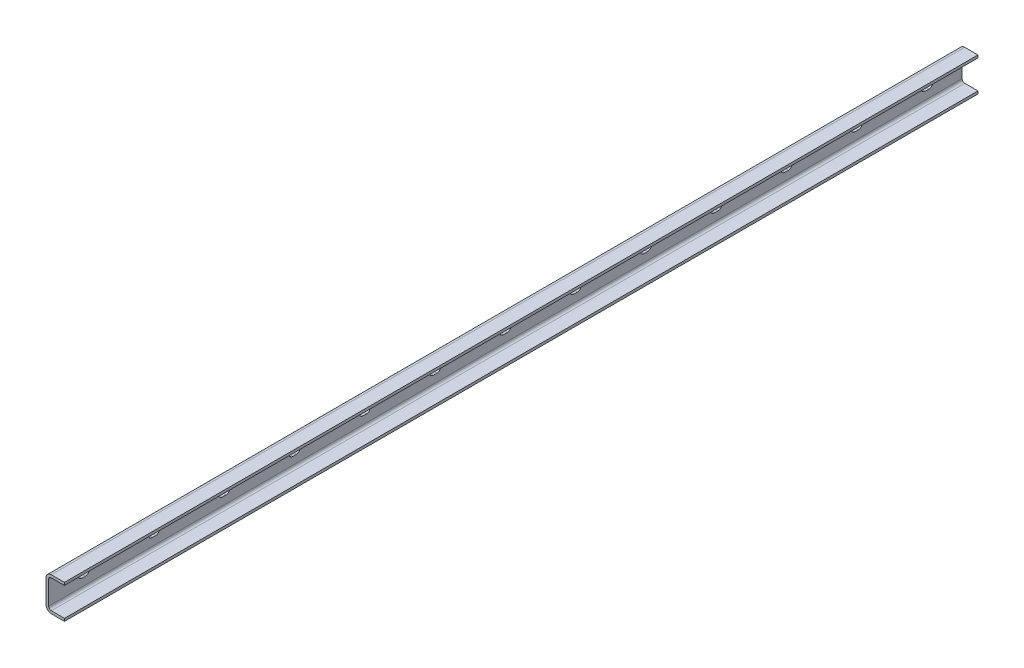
ISO-10303-21;
HEADER;
FILE_DESCRIPTION(('STEP AP214'),'2;1');
FILE_NAME('part.step','',(''),(''),'','','');
FILE_SCHEMA(('AUTOMOTIVE_DESIGN { 1 0 10303 214 1 1 1 1 }'));
ENDSEC;
DATA;
#1=APPLICATION_CONTEXT('core data for automotive mechanical design processes');
#2=APPLICATION_PROTOCOL_DEFINITION('international standard','automotive_design',2000,#1);
#3=PRODUCT_CONTEXT('',#1,'mechanical');
#4=PRODUCT('Part','Part','',(#3));
#5=PRODUCT_RELATED_PRODUCT_CATEGORY('part','',(#4));
#6=PRODUCT_DEFINITION_FORMATION('','',#4);
#7=PRODUCT_DEFINITION_CONTEXT('part definition',#1,'design');
#8=PRODUCT_DEFINITION('design','',#6,#7);
#9=PRODUCT_DEFINITION_SHAPE('','',#8);
#10=(LENGTH_UNIT() NAMED_UNIT(*) SI_UNIT(.MILLI.,.METRE.));
#11=(NAMED_UNIT(*) PLANE_ANGLE_UNIT() SI_UNIT($,.RADIAN.));
#12=(NAMED_UNIT(*) SI_UNIT($,.STERADIAN.) SOLID_ANGLE_UNIT());
#13=UNCERTAINTY_MEASURE_WITH_UNIT(LENGTH_MEASURE(1.E-05),#10,'distance_accuracy_value','');
#14=(GEOMETRIC_REPRESENTATION_CONTEXT(3) GLOBAL_UNCERTAINTY_ASSIGNED_CONTEXT((#13)) GLOBAL_UNIT_ASSIGNED_CONTEXT((#10,
#11,#12)) REPRESENTATION_CONTEXT('',''));
#15=CARTESIAN_POINT('',(0.,0.,0.));
#16=DIRECTION('',(0.,0.,1.));
#17=DIRECTION('',(1.,0.,0.));
#18=AXIS2_PLACEMENT_3D('',#15,#16,#17);
#19=CARTESIAN_POINT('',(0.,-4.5,-998.));
#20=DIRECTION('',(0.,-1.,0.));
#21=DIRECTION('',(0.,0.,-1.));
#22=AXIS2_PLACEMENT_3D('',#19,#20,#21);
#23=PLANE('',#22);
#24=DIRECTION('',(0.,0.,-1.));
#25=VECTOR('',#24,1.);
#26=CARTESIAN_POINT('',(3.,-4.5,-998.));
#27=LINE('',#26,#25);
#28=CARTESIAN_POINT('',(3.,-4.5,-998.));
#29=VERTEX_POINT('',#28);
#30=CARTESIAN_POINT('',(3.,-4.5,-1002.));
#31=VERTEX_POINT('',#30);
#32=EDGE_CURVE('E1122',#29,#31,#27,.T.);
#33=ORIENTED_EDGE('',*,*,#32,.T.);
#34=DIRECTION('',(1.,0.,0.));
#35=VECTOR('',#34,1.);
#36=CARTESIAN_POINT('',(0.,-4.5,-1002.));
#37=LINE('',#36,#35);
#38=CARTESIAN_POINT('',(0.,-4.5,-1002.));
#39=VERTEX_POINT('',#38);
#40=EDGE_CURVE('E11',#39,#31,#37,.T.);
#41=ORIENTED_EDGE('',*,*,#40,.F.);
#42=DIRECTION('',(0.,0.,-1.));
#43=VECTOR('',#42,1.);
#44=CARTESIAN_POINT('',(0.,-4.5,-998.));
#45=LINE('',#44,#43);
#46=CARTESIAN_POINT('',(0.,-4.5,-998.));
#47=VERTEX_POINT('',#46);
#48=EDGE_CURVE('E1127',#47,#39,#45,.T.);
#49=ORIENTED_EDGE('',*,*,#48,.F.);
#50=DIRECTION('',(1.,0.,0.));
#51=VECTOR('',#50,1.);
#52=CARTESIAN_POINT('',(0.,-4.5,-998.));
#53=LINE('',#52,#51);
#54=EDGE_CURVE('E1135',#47,#29,#53,.T.);
#55=ORIENTED_EDGE('',*,*,#54,.T.);
#56=EDGE_LOOP('',(#33,#41,#49,#55));
#57=FACE_BOUND('',#56,.T.);
#58=ADVANCED_FACE('F39',(#57),#23,.F.);
#59=CARTESIAN_POINT('',(0.,0.,-1002.));
#60=DIRECTION('',(1.,0.,0.));
#61=DIRECTION('',(0.,0.,-1.));
#62=AXIS2_PLACEMENT_3D('',#59,#60,#61);
#63=CYLINDRICAL_SURFACE('',#62,4.5);
#64=CARTESIAN_POINT('',(3.,0.,-1002.));
#65=DIRECTION('',(1.,0.,0.));
#66=DIRECTION('',(0.,0.,-1.));
#67=AXIS2_PLACEMENT_3D('',#64,#65,#66);
#68=CIRCLE('',#67,4.5);
#69=CARTESIAN_POINT('',(3.,4.5,-1002.));
#70=VERTEX_POINT('',#69);
#71=EDGE_CURVE('E1118',#31,#70,#68,.T.);
#72=ORIENTED_EDGE('',*,*,#71,.T.);
#73=DIRECTION('',(1.,0.,0.));
#74=VECTOR('',#73,1.);
#75=CARTESIAN_POINT('',(0.,4.5,-1002.));
#76=LINE('',#75,#74);
#77=CARTESIAN_POINT('',(0.,4.5,-1002.));
#78=VERTEX_POINT('',#77);
#79=EDGE_CURVE('E47',#78,#70,#76,.T.);
#80=ORIENTED_EDGE('',*,*,#79,.F.);
#81=CARTESIAN_POINT('',(0.,0.,-1002.));
#82=DIRECTION('',(1.,0.,0.));
#83=DIRECTION('',(0.,0.,-1.));
#84=AXIS2_PLACEMENT_3D('',#81,#82,#83);
#85=CIRCLE('',#84,4.5);
#86=EDGE_CURVE('E61',#39,#78,#85,.T.);
#87=ORIENTED_EDGE('',*,*,#86,.F.);
#88=ORIENTED_EDGE('',*,*,#40,.T.);
#89=EDGE_LOOP('',(#72,#80,#87,#88));
#90=FACE_BOUND('',#89,.T.);
#91=ADVANCED_FACE('F1148',(#90),#63,.F.);
#92=CARTESIAN_POINT('',(0.,4.5,-998.));
#93=DIRECTION('',(0.,1.,0.));
#94=DIRECTION('',(0.,0.,1.));
#95=AXIS2_PLACEMENT_3D('',#92,#93,#94);
#96=PLANE('',#95);
#97=DIRECTION('',(0.,0.,1.));
#98=VECTOR('',#97,1.);
#99=CARTESIAN_POINT('',(3.,4.5,-998.));
#100=LINE('',#99,#98);
#101=CARTESIAN_POINT('',(3.,4.5,-998.));
#102=VERTEX_POINT('',#101);
#103=EDGE_CURVE('E1114',#70,#102,#100,.T.);
#104=ORIENTED_EDGE('',*,*,#103,.T.);
#105=DIRECTION('',(1.,0.,0.));
#106=VECTOR('',#105,1.);
#107=CARTESIAN_POINT('',(0.,4.5,-998.));
#108=LINE('',#107,#106);
#109=CARTESIAN_POINT('',(0.,4.5,-998.));
#110=VERTEX_POINT('',#109);
#111=EDGE_CURVE('E1139',#110,#102,#108,.T.);
#112=ORIENTED_EDGE('',*,*,#111,.F.);
#113=DIRECTION('',(0.,0.,1.));
#114=VECTOR('',#113,1.);
#115=CARTESIAN_POINT('',(0.,4.5,-998.));
#116=LINE('',#115,#114);
#117=EDGE_CURVE('E1132',#78,#110,#116,.T.);
#118=ORIENTED_EDGE('',*,*,#117,.F.);
#119=ORIENTED_EDGE('',*,*,#79,.T.);
#120=EDGE_LOOP('',(#104,#112,#118,#119));
#121=FACE_BOUND('',#120,.T.);
#122=ADVANCED_FACE('F1145',(#121),#96,.F.);
#123=CARTESIAN_POINT('',(0.,0.,-998.));
#124=DIRECTION('',(1.,0.,0.));
#125=DIRECTION('',(0.,0.,-1.));
#126=AXIS2_PLACEMENT_3D('',#123,#124,#125);
#127=CYLINDRICAL_SURFACE('',#126,4.5);
#128=CARTESIAN_POINT('',(3.,0.,-998.));
#129=DIRECTION('',(1.,0.,0.));
#130=DIRECTION('',(0.,0.,-1.));
#131=AXIS2_PLACEMENT_3D('',#128,#129,#130);
#132=CIRCLE('',#131,4.5);
#133=EDGE_CURVE('E1111',#102,#29,#132,.T.);
#134=ORIENTED_EDGE('',*,*,#133,.T.);
#135=ORIENTED_EDGE('',*,*,#54,.F.);
#136=CARTESIAN_POINT('',(0.,0.,-998.));
#137=DIRECTION('',(1.,0.,0.));
#138=DIRECTION('',(0.,0.,-1.));
#139=AXIS2_PLACEMENT_3D('',#136,#137,#138);
#140=CIRCLE('',#139,4.5);
#141=EDGE_CURVE('E54',#110,#47,#140,.T.);
#142=ORIENTED_EDGE('',*,*,#141,.F.);
#143=ORIENTED_EDGE('',*,*,#111,.T.);
#144=EDGE_LOOP('',(#134,#135,#142,#143));
#145=FACE_BOUND('',#144,.T.);
#146=ADVANCED_FACE('F1154',(#145),#127,.F.);
#147=CARTESIAN_POINT('',(0.,-4.5,-918.));
#148=DIRECTION('',(0.,-1.,0.));
#149=DIRECTION('',(0.,0.,-1.));
#150=AXIS2_PLACEMENT_3D('',#147,#148,#149);
#151=PLANE('',#150);
#152=DIRECTION('',(0.,0.,-1.));
#153=VECTOR('',#152,1.);
#154=CARTESIAN_POINT('',(3.,-4.5,-918.));
#155=LINE('',#154,#153);
#156=CARTESIAN_POINT('',(3.,-4.5,-918.));
#157=VERTEX_POINT('',#156);
#158=CARTESIAN_POINT('',(3.,-4.5,-922.));
#159=VERTEX_POINT('',#158);
#160=EDGE_CURVE('E1078',#157,#159,#155,.T.);
#161=ORIENTED_EDGE('',*,*,#160,.T.);
#162=DIRECTION('',(1.,0.,0.));
#163=VECTOR('',#162,1.);
#164=CARTESIAN_POINT('',(0.,-4.5,-922.));
#165=LINE('',#164,#163);
#166=CARTESIAN_POINT('',(0.,-4.5,-922.));
#167=VERTEX_POINT('',#166);
#168=EDGE_CURVE('E1107',#167,#159,#165,.T.);
#169=ORIENTED_EDGE('',*,*,#168,.F.);
#170=DIRECTION('',(0.,0.,-1.));
#171=VECTOR('',#170,1.);
#172=CARTESIAN_POINT('',(0.,-4.5,-918.));
#173=LINE('',#172,#171);
#174=CARTESIAN_POINT('',(0.,-4.5,-918.));
#175=VERTEX_POINT('',#174);
#176=EDGE_CURVE('E1085',#175,#167,#173,.T.);
#177=ORIENTED_EDGE('',*,*,#176,.F.);
#178=DIRECTION('',(1.,0.,0.));
#179=VECTOR('',#178,1.);
#180=CARTESIAN_POINT('',(0.,-4.5,-918.));
#181=LINE('',#180,#179);
#182=EDGE_CURVE('E1095',#175,#157,#181,.T.);
#183=ORIENTED_EDGE('',*,*,#182,.T.);
#184=EDGE_LOOP('',(#161,#169,#177,#183));
#185=FACE_BOUND('',#184,.T.);
#186=ADVANCED_FACE('F1156',(#185),#151,.F.);
#187=CARTESIAN_POINT('',(0.,0.,-922.));
#188=DIRECTION('',(1.,0.,0.));
#189=DIRECTION('',(0.,0.,-1.));
#190=AXIS2_PLACEMENT_3D('',#187,#188,#189);
#191=CYLINDRICAL_SURFACE('',#190,4.5);
#192=CARTESIAN_POINT('',(3.,0.,-922.));
#193=DIRECTION('',(1.,0.,0.));
#194=DIRECTION('',(0.,0.,-1.));
#195=AXIS2_PLACEMENT_3D('',#192,#193,#194);
#196=CIRCLE('',#195,4.5);
#197=CARTESIAN_POINT('',(3.,4.5,-922.));
#198=VERTEX_POINT('',#197);
#199=EDGE_CURVE('E1074',#159,#198,#196,.T.);
#200=ORIENTED_EDGE('',*,*,#199,.T.);
#201=DIRECTION('',(1.,0.,0.));
#202=VECTOR('',#201,1.);
#203=CARTESIAN_POINT('',(0.,4.5,-922.));
#204=LINE('',#203,#202);
#205=CARTESIAN_POINT('',(0.,4.5,-922.));
#206=VERTEX_POINT('',#205);
#207=EDGE_CURVE('E1103',#206,#198,#204,.T.);
#208=ORIENTED_EDGE('',*,*,#207,.F.);
#209=CARTESIAN_POINT('',(0.,0.,-922.));
#210=DIRECTION('',(1.,0.,0.));
#211=DIRECTION('',(0.,0.,-1.));
#212=AXIS2_PLACEMENT_3D('',#209,#210,#211);
#213=CIRCLE('',#212,4.5);
#214=EDGE_CURVE('E1088',#167,#206,#213,.T.);
#215=ORIENTED_EDGE('',*,*,#214,.F.);
#216=ORIENTED_EDGE('',*,*,#168,.T.);
#217=EDGE_LOOP('',(#200,#208,#215,#216));
#218=FACE_BOUND('',#217,.T.);
#219=ADVANCED_FACE('F1162',(#218),#191,.F.);
#220=CARTESIAN_POINT('',(0.,4.5,-918.));
#221=DIRECTION('',(0.,1.,0.));
#222=DIRECTION('',(0.,0.,1.));
#223=AXIS2_PLACEMENT_3D('',#220,#221,#222);
#224=PLANE('',#223);
#225=DIRECTION('',(0.,0.,1.));
#226=VECTOR('',#225,1.);
#227=CARTESIAN_POINT('',(3.,4.5,-918.));
#228=LINE('',#227,#226);
#229=CARTESIAN_POINT('',(3.,4.5,-918.));
#230=VERTEX_POINT('',#229);
#231=EDGE_CURVE('E1070',#198,#230,#228,.T.);
#232=ORIENTED_EDGE('',*,*,#231,.T.);
#233=DIRECTION('',(1.,0.,0.));
#234=VECTOR('',#233,1.);
#235=CARTESIAN_POINT('',(0.,4.5,-918.));
#236=LINE('',#235,#234);
#237=CARTESIAN_POINT('',(0.,4.5,-918.));
#238=VERTEX_POINT('',#237);
#239=EDGE_CURVE('E1099',#238,#230,#236,.T.);
#240=ORIENTED_EDGE('',*,*,#239,.F.);
#241=DIRECTION('',(0.,0.,1.));
#242=VECTOR('',#241,1.);
#243=CARTESIAN_POINT('',(0.,4.5,-918.));
#244=LINE('',#243,#242);
#245=EDGE_CURVE('E1091',#206,#238,#244,.T.);
#246=ORIENTED_EDGE('',*,*,#245,.F.);
#247=ORIENTED_EDGE('',*,*,#207,.T.);
#248=EDGE_LOOP('',(#232,#240,#246,#247));
#249=FACE_BOUND('',#248,.T.);
#250=ADVANCED_FACE('F1190',(#249),#224,.F.);
#251=CARTESIAN_POINT('',(0.,0.,-918.));
#252=DIRECTION('',(1.,0.,0.));
#253=DIRECTION('',(0.,0.,-1.));
#254=AXIS2_PLACEMENT_3D('',#251,#252,#253);
#255=CYLINDRICAL_SURFACE('',#254,4.5);
#256=CARTESIAN_POINT('',(3.,0.,-918.));
#257=DIRECTION('',(1.,0.,0.));
#258=DIRECTION('',(0.,0.,-1.));
#259=AXIS2_PLACEMENT_3D('',#256,#257,#258);
#260=CIRCLE('',#259,4.5);
#261=EDGE_CURVE('E1067',#230,#157,#260,.T.);
#262=ORIENTED_EDGE('',*,*,#261,.T.);
#263=ORIENTED_EDGE('',*,*,#182,.F.);
#264=CARTESIAN_POINT('',(0.,0.,-918.));
#265=DIRECTION('',(1.,0.,0.));
#266=DIRECTION('',(0.,0.,-1.));
#267=AXIS2_PLACEMENT_3D('',#264,#265,#266);
#268=CIRCLE('',#267,4.5);
#269=EDGE_CURVE('E1082',#238,#175,#268,.T.);
#270=ORIENTED_EDGE('',*,*,#269,.F.);
#271=ORIENTED_EDGE('',*,*,#239,.T.);
#272=EDGE_LOOP('',(#262,#263,#270,#271));
#273=FACE_BOUND('',#272,.T.);
#274=ADVANCED_FACE('F1199',(#273),#255,.F.);
#275=CARTESIAN_POINT('',(0.,-4.5,-838.));
#276=DIRECTION('',(0.,-1.,0.));
#277=DIRECTION('',(0.,0.,-1.));
#278=AXIS2_PLACEMENT_3D('',#275,#276,#277);
#279=PLANE('',#278);
#280=DIRECTION('',(0.,0.,-1.));
#281=VECTOR('',#280,1.);
#282=CARTESIAN_POINT('',(3.,-4.5,-838.));
#283=LINE('',#282,#281);
#284=CARTESIAN_POINT('',(3.,-4.5,-838.));
#285=VERTEX_POINT('',#284);
#286=CARTESIAN_POINT('',(3.,-4.5,-842.));
#287=VERTEX_POINT('',#286);
#288=EDGE_CURVE('E1034',#285,#287,#283,.T.);
#289=ORIENTED_EDGE('',*,*,#288,.T.);
#290=DIRECTION('',(1.,0.,0.));
#291=VECTOR('',#290,1.);
#292=CARTESIAN_POINT('',(0.,-4.5,-842.));
#293=LINE('',#292,#291);
#294=CARTESIAN_POINT('',(0.,-4.5,-842.));
#295=VERTEX_POINT('',#294);
#296=EDGE_CURVE('E1063',#295,#287,#293,.T.);
#297=ORIENTED_EDGE('',*,*,#296,.F.);
#298=DIRECTION('',(0.,0.,-1.));
#299=VECTOR('',#298,1.);
#300=CARTESIAN_POINT('',(0.,-4.5,-838.));
#301=LINE('',#300,#299);
#302=CARTESIAN_POINT('',(0.,-4.5,-838.));
#303=VERTEX_POINT('',#302);
#304=EDGE_CURVE('E1041',#303,#295,#301,.T.);
#305=ORIENTED_EDGE('',*,*,#304,.F.);
#306=DIRECTION('',(1.,0.,0.));
#307=VECTOR('',#306,1.);
#308=CARTESIAN_POINT('',(0.,-4.5,-838.));
#309=LINE('',#308,#307);
#310=EDGE_CURVE('E1051',#303,#285,#309,.T.);
#311=ORIENTED_EDGE('',*,*,#310,.T.);
#312=EDGE_LOOP('',(#289,#297,#305,#311));
#313=FACE_BOUND('',#312,.T.);
#314=ADVANCED_FACE('F1208',(#313),#279,.F.);
#315=CARTESIAN_POINT('',(0.,0.,-842.));
#316=DIRECTION('',(1.,0.,0.));
#317=DIRECTION('',(0.,0.,-1.));
#318=AXIS2_PLACEMENT_3D('',#315,#316,#317);
#319=CYLINDRICAL_SURFACE('',#318,4.5);
#320=CARTESIAN_POINT('',(3.,0.,-842.));
#321=DIRECTION('',(1.,0.,0.));
#322=DIRECTION('',(0.,0.,-1.));
#323=AXIS2_PLACEMENT_3D('',#320,#321,#322);
#324=CIRCLE('',#323,4.5);
#325=CARTESIAN_POINT('',(3.,4.5,-842.));
#326=VERTEX_POINT('',#325);
#327=EDGE_CURVE('E1030',#287,#326,#324,.T.);
#328=ORIENTED_EDGE('',*,*,#327,.T.);
#329=DIRECTION('',(1.,0.,0.));
#330=VECTOR('',#329,1.);
#331=CARTESIAN_POINT('',(0.,4.5,-842.));
#332=LINE('',#331,#330);
#333=CARTESIAN_POINT('',(0.,4.5,-842.));
#334=VERTEX_POINT('',#333);
#335=EDGE_CURVE('E1059',#334,#326,#332,.T.);
#336=ORIENTED_EDGE('',*,*,#335,.F.);
#337=CARTESIAN_POINT('',(0.,0.,-842.));
#338=DIRECTION('',(1.,0.,0.));
#339=DIRECTION('',(0.,0.,-1.));
#340=AXIS2_PLACEMENT_3D('',#337,#338,#339);
#341=CIRCLE('',#340,4.5);
#342=EDGE_CURVE('E1044',#295,#334,#341,.T.);
#343=ORIENTED_EDGE('',*,*,#342,.F.);
#344=ORIENTED_EDGE('',*,*,#296,.T.);
#345=EDGE_LOOP('',(#328,#336,#343,#344));
#346=FACE_BOUND('',#345,.T.);
#347=ADVANCED_FACE('F1217',(#346),#319,.F.);
#348=CARTESIAN_POINT('',(0.,4.5,-838.));
#349=DIRECTION('',(0.,1.,0.));
#350=DIRECTION('',(0.,0.,1.));
#351=AXIS2_PLACEMENT_3D('',#348,#349,#350);
#352=PLANE('',#351);
#353=DIRECTION('',(0.,0.,1.));
#354=VECTOR('',#353,1.);
#355=CARTESIAN_POINT('',(3.,4.5,-838.));
#356=LINE('',#355,#354);
#357=CARTESIAN_POINT('',(3.,4.5,-838.));
#358=VERTEX_POINT('',#357);
#359=EDGE_CURVE('E1026',#326,#358,#356,.T.);
#360=ORIENTED_EDGE('',*,*,#359,.T.);
#361=DIRECTION('',(1.,0.,0.));
#362=VECTOR('',#361,1.);
#363=CARTESIAN_POINT('',(0.,4.5,-838.));
#364=LINE('',#363,#362);
#365=CARTESIAN_POINT('',(0.,4.5,-838.));
#366=VERTEX_POINT('',#365);
#367=EDGE_CURVE('E1055',#366,#358,#364,.T.);
#368=ORIENTED_EDGE('',*,*,#367,.F.);
#369=DIRECTION('',(0.,0.,1.));
#370=VECTOR('',#369,1.);
#371=CARTESIAN_POINT('',(0.,4.5,-838.));
#372=LINE('',#371,#370);
#373=EDGE_CURVE('E1047',#334,#366,#372,.T.);
#374=ORIENTED_EDGE('',*,*,#373,.F.);
#375=ORIENTED_EDGE('',*,*,#335,.T.);
#376=EDGE_LOOP('',(#360,#368,#374,#375));
#377=FACE_BOUND('',#376,.T.);
#378=ADVANCED_FACE('F1226',(#377),#352,.F.);
#379=CARTESIAN_POINT('',(0.,0.,-838.));
#380=DIRECTION('',(1.,0.,0.));
#381=DIRECTION('',(0.,0.,-1.));
#382=AXIS2_PLACEMENT_3D('',#379,#380,#381);
#383=CYLINDRICAL_SURFACE('',#382,4.5);
#384=CARTESIAN_POINT('',(3.,0.,-838.));
#385=DIRECTION('',(1.,0.,0.));
#386=DIRECTION('',(0.,0.,-1.));
#387=AXIS2_PLACEMENT_3D('',#384,#385,#386);
#388=CIRCLE('',#387,4.5);
#389=EDGE_CURVE('E1023',#358,#285,#388,.T.);
#390=ORIENTED_EDGE('',*,*,#389,.T.);
#391=ORIENTED_EDGE('',*,*,#310,.F.);
#392=CARTESIAN_POINT('',(0.,0.,-838.));
#393=DIRECTION('',(1.,0.,0.));
#394=DIRECTION('',(0.,0.,-1.));
#395=AXIS2_PLACEMENT_3D('',#392,#393,#394);
#396=CIRCLE('',#395,4.5);
#397=EDGE_CURVE('E1038',#366,#303,#396,.T.);
#398=ORIENTED_EDGE('',*,*,#397,.F.);
#399=ORIENTED_EDGE('',*,*,#367,.T.);
#400=EDGE_LOOP('',(#390,#391,#398,#399));
#401=FACE_BOUND('',#400,.T.);
#402=ADVANCED_FACE('F1235',(#401),#383,.F.);
#403=CARTESIAN_POINT('',(0.,-4.5,-758.));
#404=DIRECTION('',(0.,-1.,0.));
#405=DIRECTION('',(0.,0.,-1.));
#406=AXIS2_PLACEMENT_3D('',#403,#404,#405);
#407=PLANE('',#406);
#408=DIRECTION('',(0.,0.,-1.));
#409=VECTOR('',#408,1.);
#410=CARTESIAN_POINT('',(3.,-4.5,-758.));
#411=LINE('',#410,#409);
#412=CARTESIAN_POINT('',(3.,-4.5,-758.));
#413=VERTEX_POINT('',#412);
#414=CARTESIAN_POINT('',(3.,-4.5,-762.));
#415=VERTEX_POINT('',#414);
#416=EDGE_CURVE('E990',#413,#415,#411,.T.);
#417=ORIENTED_EDGE('',*,*,#416,.T.);
#418=DIRECTION('',(1.,0.,0.));
#419=VECTOR('',#418,1.);
#420=CARTESIAN_POINT('',(0.,-4.5,-762.));
#421=LINE('',#420,#419);
#422=CARTESIAN_POINT('',(0.,-4.5,-762.));
#423=VERTEX_POINT('',#422);
#424=EDGE_CURVE('E1019',#423,#415,#421,.T.);
#425=ORIENTED_EDGE('',*,*,#424,.F.);
#426=DIRECTION('',(0.,0.,-1.));
#427=VECTOR('',#426,1.);
#428=CARTESIAN_POINT('',(0.,-4.5,-758.));
#429=LINE('',#428,#427);
#430=CARTESIAN_POINT('',(0.,-4.5,-758.));
#431=VERTEX_POINT('',#430);
#432=EDGE_CURVE('E997',#431,#423,#429,.T.);
#433=ORIENTED_EDGE('',*,*,#432,.F.);
#434=DIRECTION('',(1.,0.,0.));
#435=VECTOR('',#434,1.);
#436=CARTESIAN_POINT('',(0.,-4.5,-758.));
#437=LINE('',#436,#435);
#438=EDGE_CURVE('E1007',#431,#413,#437,.T.);
#439=ORIENTED_EDGE('',*,*,#438,.T.);
#440=EDGE_LOOP('',(#417,#425,#433,#439));
#441=FACE_BOUND('',#440,.T.);
#442=ADVANCED_FACE('F1244',(#441),#407,.F.);
#443=CARTESIAN_POINT('',(0.,0.,-762.));
#444=DIRECTION('',(1.,0.,0.));
#445=DIRECTION('',(0.,0.,-1.));
#446=AXIS2_PLACEMENT_3D('',#443,#444,#445);
#447=CYLINDRICAL_SURFACE('',#446,4.5);
#448=CARTESIAN_POINT('',(3.,0.,-762.));
#449=DIRECTION('',(1.,0.,0.));
#450=DIRECTION('',(0.,0.,-1.));
#451=AXIS2_PLACEMENT_3D('',#448,#449,#450);
#452=CIRCLE('',#451,4.5);
#453=CARTESIAN_POINT('',(3.,4.5,-762.));
#454=VERTEX_POINT('',#453);
#455=EDGE_CURVE('E986',#415,#454,#452,.T.);
#456=ORIENTED_EDGE('',*,*,#455,.T.);
#457=DIRECTION('',(1.,0.,0.));
#458=VECTOR('',#457,1.);
#459=CARTESIAN_POINT('',(0.,4.5,-762.));
#460=LINE('',#459,#458);
#461=CARTESIAN_POINT('',(0.,4.5,-762.));
#462=VERTEX_POINT('',#461);
#463=EDGE_CURVE('E1015',#462,#454,#460,.T.);
#464=ORIENTED_EDGE('',*,*,#463,.F.);
#465=CARTESIAN_POINT('',(0.,0.,-762.));
#466=DIRECTION('',(1.,0.,0.));
#467=DIRECTION('',(0.,0.,-1.));
#468=AXIS2_PLACEMENT_3D('',#465,#466,#467);
#469=CIRCLE('',#468,4.5);
#470=EDGE_CURVE('E1000',#423,#462,#469,.T.);
#471=ORIENTED_EDGE('',*,*,#470,.F.);
#472=ORIENTED_EDGE('',*,*,#424,.T.);
#473=EDGE_LOOP('',(#456,#464,#471,#472));
#474=FACE_BOUND('',#473,.T.);
#475=ADVANCED_FACE('F1253',(#474),#447,.F.);
#476=CARTESIAN_POINT('',(0.,4.5,-758.));
#477=DIRECTION('',(0.,1.,0.));
#478=DIRECTION('',(0.,0.,1.));
#479=AXIS2_PLACEMENT_3D('',#476,#477,#478);
#480=PLANE('',#479);
#481=DIRECTION('',(0.,0.,1.));
#482=VECTOR('',#481,1.);
#483=CARTESIAN_POINT('',(3.,4.5,-758.));
#484=LINE('',#483,#482);
#485=CARTESIAN_POINT('',(3.,4.5,-758.));
#486=VERTEX_POINT('',#485);
#487=EDGE_CURVE('E982',#454,#486,#484,.T.);
#488=ORIENTED_EDGE('',*,*,#487,.T.);
#489=DIRECTION('',(1.,0.,0.));
#490=VECTOR('',#489,1.);
#491=CARTESIAN_POINT('',(0.,4.5,-758.));
#492=LINE('',#491,#490);
#493=CARTESIAN_POINT('',(0.,4.5,-758.));
#494=VERTEX_POINT('',#493);
#495=EDGE_CURVE('E1011',#494,#486,#492,.T.);
#496=ORIENTED_EDGE('',*,*,#495,.F.);
#497=DIRECTION('',(0.,0.,1.));
#498=VECTOR('',#497,1.);
#499=CARTESIAN_POINT('',(0.,4.5,-758.));
#500=LINE('',#499,#498);
#501=EDGE_CURVE('E1003',#462,#494,#500,.T.);
#502=ORIENTED_EDGE('',*,*,#501,.F.);
#503=ORIENTED_EDGE('',*,*,#463,.T.);
#504=EDGE_LOOP('',(#488,#496,#502,#503));
#505=FACE_BOUND('',#504,.T.);
#506=ADVANCED_FACE('F1262',(#505),#480,.F.);
#507=CARTESIAN_POINT('',(0.,0.,-758.));
#508=DIRECTION('',(1.,0.,0.));
#509=DIRECTION('',(0.,0.,-1.));
#510=AXIS2_PLACEMENT_3D('',#507,#508,#509);
#511=CYLINDRICAL_SURFACE('',#510,4.5);
#512=CARTESIAN_POINT('',(3.,0.,-758.));
#513=DIRECTION('',(1.,0.,0.));
#514=DIRECTION('',(0.,0.,-1.));
#515=AXIS2_PLACEMENT_3D('',#512,#513,#514);
#516=CIRCLE('',#515,4.5);
#517=EDGE_CURVE('E979',#486,#413,#516,.T.);
#518=ORIENTED_EDGE('',*,*,#517,.T.);
#519=ORIENTED_EDGE('',*,*,#438,.F.);
#520=CARTESIAN_POINT('',(0.,0.,-758.));
#521=DIRECTION('',(1.,0.,0.));
#522=DIRECTION('',(0.,0.,-1.));
#523=AXIS2_PLACEMENT_3D('',#520,#521,#522);
#524=CIRCLE('',#523,4.5);
#525=EDGE_CURVE('E994',#494,#431,#524,.T.);
#526=ORIENTED_EDGE('',*,*,#525,.F.);
#527=ORIENTED_EDGE('',*,*,#495,.T.);
#528=EDGE_LOOP('',(#518,#519,#526,#527));
#529=FACE_BOUND('',#528,.T.);
#530=ADVANCED_FACE('F1271',(#529),#511,.F.);
#531=CARTESIAN_POINT('',(0.,-4.5,-678.));
#532=DIRECTION('',(0.,-1.,0.));
#533=DIRECTION('',(0.,0.,-1.));
#534=AXIS2_PLACEMENT_3D('',#531,#532,#533);
#535=PLANE('',#534);
#536=DIRECTION('',(0.,0.,-1.));
#537=VECTOR('',#536,1.);
#538=CARTESIAN_POINT('',(3.,-4.5,-678.));
#539=LINE('',#538,#537);
#540=CARTESIAN_POINT('',(3.,-4.5,-678.));
#541=VERTEX_POINT('',#540);
#542=CARTESIAN_POINT('',(3.,-4.5,-682.));
#543=VERTEX_POINT('',#542);
#544=EDGE_CURVE('E946',#541,#543,#539,.T.);
#545=ORIENTED_EDGE('',*,*,#544,.T.);
#546=DIRECTION('',(1.,0.,0.));
#547=VECTOR('',#546,1.);
#548=CARTESIAN_POINT('',(0.,-4.5,-682.));
#549=LINE('',#548,#547);
#550=CARTESIAN_POINT('',(0.,-4.5,-682.));
#551=VERTEX_POINT('',#550);
#552=EDGE_CURVE('E975',#551,#543,#549,.T.);
#553=ORIENTED_EDGE('',*,*,#552,.F.);
#554=DIRECTION('',(0.,0.,-1.));
#555=VECTOR('',#554,1.);
#556=CARTESIAN_POINT('',(0.,-4.5,-678.));
#557=LINE('',#556,#555);
#558=CARTESIAN_POINT('',(0.,-4.5,-678.));
#559=VERTEX_POINT('',#558);
#560=EDGE_CURVE('E953',#559,#551,#557,.T.);
#561=ORIENTED_EDGE('',*,*,#560,.F.);
#562=DIRECTION('',(1.,0.,0.));
#563=VECTOR('',#562,1.);
#564=CARTESIAN_POINT('',(0.,-4.5,-678.));
#565=LINE('',#564,#563);
#566=EDGE_CURVE('E963',#559,#541,#565,.T.);
#567=ORIENTED_EDGE('',*,*,#566,.T.);
#568=EDGE_LOOP('',(#545,#553,#561,#567));
#569=FACE_BOUND('',#568,.T.);
#570=ADVANCED_FACE('F1280',(#569),#535,.F.);
#571=CARTESIAN_POINT('',(0.,0.,-682.));
#572=DIRECTION('',(1.,0.,0.));
#573=DIRECTION('',(0.,0.,-1.));
#574=AXIS2_PLACEMENT_3D('',#571,#572,#573);
#575=CYLINDRICAL_SURFACE('',#574,4.5);
#576=CARTESIAN_POINT('',(3.,0.,-682.));
#577=DIRECTION('',(1.,0.,0.));
#578=DIRECTION('',(0.,0.,-1.));
#579=AXIS2_PLACEMENT_3D('',#576,#577,#578);
#580=CIRCLE('',#579,4.5);
#581=CARTESIAN_POINT('',(3.,4.5,-682.));
#582=VERTEX_POINT('',#581);
#583=EDGE_CURVE('E942',#543,#582,#580,.T.);
#584=ORIENTED_EDGE('',*,*,#583,.T.);
#585=DIRECTION('',(1.,0.,0.));
#586=VECTOR('',#585,1.);
#587=CARTESIAN_POINT('',(0.,4.5,-682.));
#588=LINE('',#587,#586);
#589=CARTESIAN_POINT('',(0.,4.5,-682.));
#590=VERTEX_POINT('',#589);
#591=EDGE_CURVE('E971',#590,#582,#588,.T.);
#592=ORIENTED_EDGE('',*,*,#591,.F.);
#593=CARTESIAN_POINT('',(0.,0.,-682.));
#594=DIRECTION('',(1.,0.,0.));
#595=DIRECTION('',(0.,0.,-1.));
#596=AXIS2_PLACEMENT_3D('',#593,#594,#595);
#597=CIRCLE('',#596,4.5);
#598=EDGE_CURVE('E956',#551,#590,#597,.T.);
#599=ORIENTED_EDGE('',*,*,#598,.F.);
#600=ORIENTED_EDGE('',*,*,#552,.T.);
#601=EDGE_LOOP('',(#584,#592,#599,#600));
#602=FACE_BOUND('',#601,.T.);
#603=ADVANCED_FACE('F1289',(#602),#575,.F.);
#604=CARTESIAN_POINT('',(0.,4.5,-678.));
#605=DIRECTION('',(0.,1.,0.));
#606=DIRECTION('',(0.,0.,1.));
#607=AXIS2_PLACEMENT_3D('',#604,#605,#606);
#608=PLANE('',#607);
#609=DIRECTION('',(0.,0.,1.));
#610=VECTOR('',#609,1.);
#611=CARTESIAN_POINT('',(3.,4.5,-678.));
#612=LINE('',#611,#610);
#613=CARTESIAN_POINT('',(3.,4.5,-678.));
#614=VERTEX_POINT('',#613);
#615=EDGE_CURVE('E938',#582,#614,#612,.T.);
#616=ORIENTED_EDGE('',*,*,#615,.T.);
#617=DIRECTION('',(1.,0.,0.));
#618=VECTOR('',#617,1.);
#619=CARTESIAN_POINT('',(0.,4.5,-678.));
#620=LINE('',#619,#618);
#621=CARTESIAN_POINT('',(0.,4.5,-678.));
#622=VERTEX_POINT('',#621);
#623=EDGE_CURVE('E967',#622,#614,#620,.T.);
#624=ORIENTED_EDGE('',*,*,#623,.F.);
#625=DIRECTION('',(0.,0.,1.));
#626=VECTOR('',#625,1.);
#627=CARTESIAN_POINT('',(0.,4.5,-678.));
#628=LINE('',#627,#626);
#629=EDGE_CURVE('E959',#590,#622,#628,.T.);
#630=ORIENTED_EDGE('',*,*,#629,.F.);
#631=ORIENTED_EDGE('',*,*,#591,.T.);
#632=EDGE_LOOP('',(#616,#624,#630,#631));
#633=FACE_BOUND('',#632,.T.);
#634=ADVANCED_FACE('F1298',(#633),#608,.F.);
#635=CARTESIAN_POINT('',(0.,0.,-678.));
#636=DIRECTION('',(1.,0.,0.));
#637=DIRECTION('',(0.,0.,-1.));
#638=AXIS2_PLACEMENT_3D('',#635,#636,#637);
#639=CYLINDRICAL_SURFACE('',#638,4.5);
#640=CARTESIAN_POINT('',(3.,0.,-678.));
#641=DIRECTION('',(1.,0.,0.));
#642=DIRECTION('',(0.,0.,-1.));
#643=AXIS2_PLACEMENT_3D('',#640,#641,#642);
#644=CIRCLE('',#643,4.5);
#645=EDGE_CURVE('E935',#614,#541,#644,.T.);
#646=ORIENTED_EDGE('',*,*,#645,.T.);
#647=ORIENTED_EDGE('',*,*,#566,.F.);
#648=CARTESIAN_POINT('',(0.,0.,-678.));
#649=DIRECTION('',(1.,0.,0.));
#650=DIRECTION('',(0.,0.,-1.));
#651=AXIS2_PLACEMENT_3D('',#648,#649,#650);
#652=CIRCLE('',#651,4.5);
#653=EDGE_CURVE('E950',#622,#559,#652,.T.);
#654=ORIENTED_EDGE('',*,*,#653,.F.);
#655=ORIENTED_EDGE('',*,*,#623,.T.);
#656=EDGE_LOOP('',(#646,#647,#654,#655));
#657=FACE_BOUND('',#656,.T.);
#658=ADVANCED_FACE('F1307',(#657),#639,.F.);
#659=CARTESIAN_POINT('',(0.,-4.5,-598.));
#660=DIRECTION('',(0.,-1.,0.));
#661=DIRECTION('',(0.,0.,-1.));
#662=AXIS2_PLACEMENT_3D('',#659,#660,#661);
#663=PLANE('',#662);
#664=DIRECTION('',(0.,0.,-1.));
#665=VECTOR('',#664,1.);
#666=CARTESIAN_POINT('',(3.,-4.5,-598.));
#667=LINE('',#666,#665);
#668=CARTESIAN_POINT('',(3.,-4.5,-598.));
#669=VERTEX_POINT('',#668);
#670=CARTESIAN_POINT('',(3.,-4.5,-602.));
#671=VERTEX_POINT('',#670);
#672=EDGE_CURVE('E902',#669,#671,#667,.T.);
#673=ORIENTED_EDGE('',*,*,#672,.T.);
#674=DIRECTION('',(1.,0.,0.));
#675=VECTOR('',#674,1.);
#676=CARTESIAN_POINT('',(0.,-4.5,-602.));
#677=LINE('',#676,#675);
#678=CARTESIAN_POINT('',(0.,-4.5,-602.));
#679=VERTEX_POINT('',#678);
#680=EDGE_CURVE('E931',#679,#671,#677,.T.);
#681=ORIENTED_EDGE('',*,*,#680,.F.);
#682=DIRECTION('',(0.,0.,-1.));
#683=VECTOR('',#682,1.);
#684=CARTESIAN_POINT('',(0.,-4.5,-598.));
#685=LINE('',#684,#683);
#686=CARTESIAN_POINT('',(0.,-4.5,-598.));
#687=VERTEX_POINT('',#686);
#688=EDGE_CURVE('E909',#687,#679,#685,.T.);
#689=ORIENTED_EDGE('',*,*,#688,.F.);
#690=DIRECTION('',(1.,0.,0.));
#691=VECTOR('',#690,1.);
#692=CARTESIAN_POINT('',(0.,-4.5,-598.));
#693=LINE('',#692,#691);
#694=EDGE_CURVE('E919',#687,#669,#693,.T.);
#695=ORIENTED_EDGE('',*,*,#694,.T.);
#696=EDGE_LOOP('',(#673,#681,#689,#695));
#697=FACE_BOUND('',#696,.T.);
#698=ADVANCED_FACE('F1316',(#697),#663,.F.);
#699=CARTESIAN_POINT('',(0.,0.,-602.));
#700=DIRECTION('',(1.,0.,0.));
#701=DIRECTION('',(0.,0.,-1.));
#702=AXIS2_PLACEMENT_3D('',#699,#700,#701);
#703=CYLINDRICAL_SURFACE('',#702,4.5);
#704=CARTESIAN_POINT('',(3.,0.,-602.));
#705=DIRECTION('',(1.,0.,0.));
#706=DIRECTION('',(0.,0.,-1.));
#707=AXIS2_PLACEMENT_3D('',#704,#705,#706);
#708=CIRCLE('',#707,4.5);
#709=CARTESIAN_POINT('',(3.,4.5,-602.));
#710=VERTEX_POINT('',#709);
#711=EDGE_CURVE('E898',#671,#710,#708,.T.);
#712=ORIENTED_EDGE('',*,*,#711,.T.);
#713=DIRECTION('',(1.,0.,0.));
#714=VECTOR('',#713,1.);
#715=CARTESIAN_POINT('',(0.,4.5,-602.));
#716=LINE('',#715,#714);
#717=CARTESIAN_POINT('',(0.,4.5,-602.));
#718=VERTEX_POINT('',#717);
#719=EDGE_CURVE('E927',#718,#710,#716,.T.);
#720=ORIENTED_EDGE('',*,*,#719,.F.);
#721=CARTESIAN_POINT('',(0.,0.,-602.));
#722=DIRECTION('',(1.,0.,0.));
#723=DIRECTION('',(0.,0.,-1.));
#724=AXIS2_PLACEMENT_3D('',#721,#722,#723);
#725=CIRCLE('',#724,4.5);
#726=EDGE_CURVE('E912',#679,#718,#725,.T.);
#727=ORIENTED_EDGE('',*,*,#726,.F.);
#728=ORIENTED_EDGE('',*,*,#680,.T.);
#729=EDGE_LOOP('',(#712,#720,#727,#728));
#730=FACE_BOUND('',#729,.T.);
#731=ADVANCED_FACE('F1325',(#730),#703,.F.);
#732=CARTESIAN_POINT('',(0.,4.5,-598.));
#733=DIRECTION('',(0.,1.,0.));
#734=DIRECTION('',(0.,0.,1.));
#735=AXIS2_PLACEMENT_3D('',#732,#733,#734);
#736=PLANE('',#735);
#737=DIRECTION('',(0.,0.,1.));
#738=VECTOR('',#737,1.);
#739=CARTESIAN_POINT('',(3.,4.5,-598.));
#740=LINE('',#739,#738);
#741=CARTESIAN_POINT('',(3.,4.5,-598.));
#742=VERTEX_POINT('',#741);
#743=EDGE_CURVE('E894',#710,#742,#740,.T.);
#744=ORIENTED_EDGE('',*,*,#743,.T.);
#745=DIRECTION('',(1.,0.,0.));
#746=VECTOR('',#745,1.);
#747=CARTESIAN_POINT('',(0.,4.5,-598.));
#748=LINE('',#747,#746);
#749=CARTESIAN_POINT('',(0.,4.5,-598.));
#750=VERTEX_POINT('',#749);
#751=EDGE_CURVE('E923',#750,#742,#748,.T.);
#752=ORIENTED_EDGE('',*,*,#751,.F.);
#753=DIRECTION('',(0.,0.,1.));
#754=VECTOR('',#753,1.);
#755=CARTESIAN_POINT('',(0.,4.5,-598.));
#756=LINE('',#755,#754);
#757=EDGE_CURVE('E915',#718,#750,#756,.T.);
#758=ORIENTED_EDGE('',*,*,#757,.F.);
#759=ORIENTED_EDGE('',*,*,#719,.T.);
#760=EDGE_LOOP('',(#744,#752,#758,#759));
#761=FACE_BOUND('',#760,.T.);
#762=ADVANCED_FACE('F1334',(#761),#736,.F.);
#763=CARTESIAN_POINT('',(0.,0.,-598.));
#764=DIRECTION('',(1.,0.,0.));
#765=DIRECTION('',(0.,0.,-1.));
#766=AXIS2_PLACEMENT_3D('',#763,#764,#765);
#767=CYLINDRICAL_SURFACE('',#766,4.5);
#768=CARTESIAN_POINT('',(3.,0.,-598.));
#769=DIRECTION('',(1.,0.,0.));
#770=DIRECTION('',(0.,0.,-1.));
#771=AXIS2_PLACEMENT_3D('',#768,#769,#770);
#772=CIRCLE('',#771,4.5);
#773=EDGE_CURVE('E891',#742,#669,#772,.T.);
#774=ORIENTED_EDGE('',*,*,#773,.T.);
#775=ORIENTED_EDGE('',*,*,#694,.F.);
#776=CARTESIAN_POINT('',(0.,0.,-598.));
#777=DIRECTION('',(1.,0.,0.));
#778=DIRECTION('',(0.,0.,-1.));
#779=AXIS2_PLACEMENT_3D('',#776,#777,#778);
#780=CIRCLE('',#779,4.5);
#781=EDGE_CURVE('E906',#750,#687,#780,.T.);
#782=ORIENTED_EDGE('',*,*,#781,.F.);
#783=ORIENTED_EDGE('',*,*,#751,.T.);
#784=EDGE_LOOP('',(#774,#775,#782,#783));
#785=FACE_BOUND('',#784,.T.);
#786=ADVANCED_FACE('F1343',(#785),#767,.F.);
#787=CARTESIAN_POINT('',(0.,-4.5,-518.));
#788=DIRECTION('',(0.,-1.,0.));
#789=DIRECTION('',(0.,0.,-1.));
#790=AXIS2_PLACEMENT_3D('',#787,#788,#789);
#791=PLANE('',#790);
#792=DIRECTION('',(0.,0.,-1.));
#793=VECTOR('',#792,1.);
#794=CARTESIAN_POINT('',(3.,-4.5,-518.));
#795=LINE('',#794,#793);
#796=CARTESIAN_POINT('',(3.,-4.5,-518.));
#797=VERTEX_POINT('',#796);
#798=CARTESIAN_POINT('',(3.,-4.5,-522.));
#799=VERTEX_POINT('',#798);
#800=EDGE_CURVE('E858',#797,#799,#795,.T.);
#801=ORIENTED_EDGE('',*,*,#800,.T.);
#802=DIRECTION('',(1.,0.,0.));
#803=VECTOR('',#802,1.);
#804=CARTESIAN_POINT('',(0.,-4.5,-522.));
#805=LINE('',#804,#803);
#806=CARTESIAN_POINT('',(0.,-4.5,-522.));
#807=VERTEX_POINT('',#806);
#808=EDGE_CURVE('E887',#807,#799,#805,.T.);
#809=ORIENTED_EDGE('',*,*,#808,.F.);
#810=DIRECTION('',(0.,0.,-1.));
#811=VECTOR('',#810,1.);
#812=CARTESIAN_POINT('',(0.,-4.5,-518.));
#813=LINE('',#812,#811);
#814=CARTESIAN_POINT('',(0.,-4.5,-518.));
#815=VERTEX_POINT('',#814);
#816=EDGE_CURVE('E865',#815,#807,#813,.T.);
#817=ORIENTED_EDGE('',*,*,#816,.F.);
#818=DIRECTION('',(1.,0.,0.));
#819=VECTOR('',#818,1.);
#820=CARTESIAN_POINT('',(0.,-4.5,-518.));
#821=LINE('',#820,#819);
#822=EDGE_CURVE('E875',#815,#797,#821,.T.);
#823=ORIENTED_EDGE('',*,*,#822,.T.);
#824=EDGE_LOOP('',(#801,#809,#817,#823));
#825=FACE_BOUND('',#824,.T.);
#826=ADVANCED_FACE('F1352',(#825),#791,.F.);
#827=CARTESIAN_POINT('',(0.,0.,-522.));
#828=DIRECTION('',(1.,0.,0.));
#829=DIRECTION('',(0.,0.,-1.));
#830=AXIS2_PLACEMENT_3D('',#827,#828,#829);
#831=CYLINDRICAL_SURFACE('',#830,4.5);
#832=CARTESIAN_POINT('',(3.,0.,-522.));
#833=DIRECTION('',(1.,0.,0.));
#834=DIRECTION('',(0.,0.,-1.));
#835=AXIS2_PLACEMENT_3D('',#832,#833,#834);
#836=CIRCLE('',#835,4.5);
#837=CARTESIAN_POINT('',(3.,4.5,-522.));
#838=VERTEX_POINT('',#837);
#839=EDGE_CURVE('E854',#799,#838,#836,.T.);
#840=ORIENTED_EDGE('',*,*,#839,.T.);
#841=DIRECTION('',(1.,0.,0.));
#842=VECTOR('',#841,1.);
#843=CARTESIAN_POINT('',(0.,4.5,-522.));
#844=LINE('',#843,#842);
#845=CARTESIAN_POINT('',(0.,4.5,-522.));
#846=VERTEX_POINT('',#845);
#847=EDGE_CURVE('E883',#846,#838,#844,.T.);
#848=ORIENTED_EDGE('',*,*,#847,.F.);
#849=CARTESIAN_POINT('',(0.,0.,-522.));
#850=DIRECTION('',(1.,0.,0.));
#851=DIRECTION('',(0.,0.,-1.));
#852=AXIS2_PLACEMENT_3D('',#849,#850,#851);
#853=CIRCLE('',#852,4.5);
#854=EDGE_CURVE('E868',#807,#846,#853,.T.);
#855=ORIENTED_EDGE('',*,*,#854,.F.);
#856=ORIENTED_EDGE('',*,*,#808,.T.);
#857=EDGE_LOOP('',(#840,#848,#855,#856));
#858=FACE_BOUND('',#857,.T.);
#859=ADVANCED_FACE('F1361',(#858),#831,.F.);
#860=CARTESIAN_POINT('',(0.,4.5,-518.));
#861=DIRECTION('',(0.,1.,0.));
#862=DIRECTION('',(0.,0.,1.));
#863=AXIS2_PLACEMENT_3D('',#860,#861,#862);
#864=PLANE('',#863);
#865=DIRECTION('',(0.,0.,1.));
#866=VECTOR('',#865,1.);
#867=CARTESIAN_POINT('',(3.,4.5,-518.));
#868=LINE('',#867,#866);
#869=CARTESIAN_POINT('',(3.,4.5,-518.));
#870=VERTEX_POINT('',#869);
#871=EDGE_CURVE('E850',#838,#870,#868,.T.);
#872=ORIENTED_EDGE('',*,*,#871,.T.);
#873=DIRECTION('',(1.,0.,0.));
#874=VECTOR('',#873,1.);
#875=CARTESIAN_POINT('',(0.,4.5,-518.));
#876=LINE('',#875,#874);
#877=CARTESIAN_POINT('',(0.,4.5,-518.));
#878=VERTEX_POINT('',#877);
#879=EDGE_CURVE('E879',#878,#870,#876,.T.);
#880=ORIENTED_EDGE('',*,*,#879,.F.);
#881=DIRECTION('',(0.,0.,1.));
#882=VECTOR('',#881,1.);
#883=CARTESIAN_POINT('',(0.,4.5,-518.));
#884=LINE('',#883,#882);
#885=EDGE_CURVE('E871',#846,#878,#884,.T.);
#886=ORIENTED_EDGE('',*,*,#885,.F.);
#887=ORIENTED_EDGE('',*,*,#847,.T.);
#888=EDGE_LOOP('',(#872,#880,#886,#887));
#889=FACE_BOUND('',#888,.T.);
#890=ADVANCED_FACE('F1370',(#889),#864,.F.);
#891=CARTESIAN_POINT('',(0.,0.,-518.));
#892=DIRECTION('',(1.,0.,0.));
#893=DIRECTION('',(0.,0.,-1.));
#894=AXIS2_PLACEMENT_3D('',#891,#892,#893);
#895=CYLINDRICAL_SURFACE('',#894,4.5);
#896=CARTESIAN_POINT('',(3.,0.,-518.));
#897=DIRECTION('',(1.,0.,0.));
#898=DIRECTION('',(0.,0.,-1.));
#899=AXIS2_PLACEMENT_3D('',#896,#897,#898);
#900=CIRCLE('',#899,4.5);
#901=EDGE_CURVE('E847',#870,#797,#900,.T.);
#902=ORIENTED_EDGE('',*,*,#901,.T.);
#903=ORIENTED_EDGE('',*,*,#822,.F.);
#904=CARTESIAN_POINT('',(0.,0.,-518.));
#905=DIRECTION('',(1.,0.,0.));
#906=DIRECTION('',(0.,0.,-1.));
#907=AXIS2_PLACEMENT_3D('',#904,#905,#906);
#908=CIRCLE('',#907,4.5);
#909=EDGE_CURVE('E862',#878,#815,#908,.T.);
#910=ORIENTED_EDGE('',*,*,#909,.F.);
#911=ORIENTED_EDGE('',*,*,#879,.T.);
#912=EDGE_LOOP('',(#902,#903,#910,#911));
#913=FACE_BOUND('',#912,.T.);
#914=ADVANCED_FACE('F1379',(#913),#895,.F.);
#915=CARTESIAN_POINT('',(0.,-4.5,-438.));
#916=DIRECTION('',(0.,-1.,0.));
#917=DIRECTION('',(0.,0.,-1.));
#918=AXIS2_PLACEMENT_3D('',#915,#916,#917);
#919=PLANE('',#918);
#920=DIRECTION('',(0.,0.,-1.));
#921=VECTOR('',#920,1.);
#922=CARTESIAN_POINT('',(3.,-4.5,-438.));
#923=LINE('',#922,#921);
#924=CARTESIAN_POINT('',(3.,-4.5,-438.));
#925=VERTEX_POINT('',#924);
#926=CARTESIAN_POINT('',(3.,-4.5,-442.));
#927=VERTEX_POINT('',#926);
#928=EDGE_CURVE('E814',#925,#927,#923,.T.);
#929=ORIENTED_EDGE('',*,*,#928,.T.);
#930=DIRECTION('',(1.,0.,0.));
#931=VECTOR('',#930,1.);
#932=CARTESIAN_POINT('',(0.,-4.5,-442.));
#933=LINE('',#932,#931);
#934=CARTESIAN_POINT('',(0.,-4.5,-442.));
#935=VERTEX_POINT('',#934);
#936=EDGE_CURVE('E843',#935,#927,#933,.T.);
#937=ORIENTED_EDGE('',*,*,#936,.F.);
#938=DIRECTION('',(0.,0.,-1.));
#939=VECTOR('',#938,1.);
#940=CARTESIAN_POINT('',(0.,-4.5,-438.));
#941=LINE('',#940,#939);
#942=CARTESIAN_POINT('',(0.,-4.5,-438.));
#943=VERTEX_POINT('',#942);
#944=EDGE_CURVE('E821',#943,#935,#941,.T.);
#945=ORIENTED_EDGE('',*,*,#944,.F.);
#946=DIRECTION('',(1.,0.,0.));
#947=VECTOR('',#946,1.);
#948=CARTESIAN_POINT('',(0.,-4.5,-438.));
#949=LINE('',#948,#947);
#950=EDGE_CURVE('E831',#943,#925,#949,.T.);
#951=ORIENTED_EDGE('',*,*,#950,.T.);
#952=EDGE_LOOP('',(#929,#937,#945,#951));
#953=FACE_BOUND('',#952,.T.);
#954=ADVANCED_FACE('F1388',(#953),#919,.F.);
#955=CARTESIAN_POINT('',(0.,0.,-442.));
#956=DIRECTION('',(1.,0.,0.));
#957=DIRECTION('',(0.,0.,-1.));
#958=AXIS2_PLACEMENT_3D('',#955,#956,#957);
#959=CYLINDRICAL_SURFACE('',#958,4.5);
#960=CARTESIAN_POINT('',(3.,0.,-442.));
#961=DIRECTION('',(1.,0.,0.));
#962=DIRECTION('',(0.,0.,-1.));
#963=AXIS2_PLACEMENT_3D('',#960,#961,#962);
#964=CIRCLE('',#963,4.5);
#965=CARTESIAN_POINT('',(3.,4.5,-442.));
#966=VERTEX_POINT('',#965);
#967=EDGE_CURVE('E810',#927,#966,#964,.T.);
#968=ORIENTED_EDGE('',*,*,#967,.T.);
#969=DIRECTION('',(1.,0.,0.));
#970=VECTOR('',#969,1.);
#971=CARTESIAN_POINT('',(0.,4.5,-442.));
#972=LINE('',#971,#970);
#973=CARTESIAN_POINT('',(0.,4.5,-442.));
#974=VERTEX_POINT('',#973);
#975=EDGE_CURVE('E839',#974,#966,#972,.T.);
#976=ORIENTED_EDGE('',*,*,#975,.F.);
#977=CARTESIAN_POINT('',(0.,0.,-442.));
#978=DIRECTION('',(1.,0.,0.));
#979=DIRECTION('',(0.,0.,-1.));
#980=AXIS2_PLACEMENT_3D('',#977,#978,#979);
#981=CIRCLE('',#980,4.5);
#982=EDGE_CURVE('E824',#935,#974,#981,.T.);
#983=ORIENTED_EDGE('',*,*,#982,.F.);
#984=ORIENTED_EDGE('',*,*,#936,.T.);
#985=EDGE_LOOP('',(#968,#976,#983,#984));
#986=FACE_BOUND('',#985,.T.);
#987=ADVANCED_FACE('F1397',(#986),#959,.F.);
#988=CARTESIAN_POINT('',(0.,4.5,-438.));
#989=DIRECTION('',(0.,1.,0.));
#990=DIRECTION('',(0.,0.,1.));
#991=AXIS2_PLACEMENT_3D('',#988,#989,#990);
#992=PLANE('',#991);
#993=DIRECTION('',(0.,0.,1.));
#994=VECTOR('',#993,1.);
#995=CARTESIAN_POINT('',(3.,4.5,-438.));
#996=LINE('',#995,#994);
#997=CARTESIAN_POINT('',(3.,4.5,-438.));
#998=VERTEX_POINT('',#997);
#999=EDGE_CURVE('E806',#966,#998,#996,.T.);
#1000=ORIENTED_EDGE('',*,*,#999,.T.);
#1001=DIRECTION('',(1.,0.,0.));
#1002=VECTOR('',#1001,1.);
#1003=CARTESIAN_POINT('',(0.,4.5,-438.));
#1004=LINE('',#1003,#1002);
#1005=CARTESIAN_POINT('',(0.,4.5,-438.));
#1006=VERTEX_POINT('',#1005);
#1007=EDGE_CURVE('E835',#1006,#998,#1004,.T.);
#1008=ORIENTED_EDGE('',*,*,#1007,.F.);
#1009=DIRECTION('',(0.,0.,1.));
#1010=VECTOR('',#1009,1.);
#1011=CARTESIAN_POINT('',(0.,4.5,-438.));
#1012=LINE('',#1011,#1010);
#1013=EDGE_CURVE('E827',#974,#1006,#1012,.T.);
#1014=ORIENTED_EDGE('',*,*,#1013,.F.);
#1015=ORIENTED_EDGE('',*,*,#975,.T.);
#1016=EDGE_LOOP('',(#1000,#1008,#1014,#1015));
#1017=FACE_BOUND('',#1016,.T.);
#1018=ADVANCED_FACE('F1406',(#1017),#992,.F.);
#1019=CARTESIAN_POINT('',(0.,0.,-438.));
#1020=DIRECTION('',(1.,0.,0.));
#1021=DIRECTION('',(0.,0.,-1.));
#1022=AXIS2_PLACEMENT_3D('',#1019,#1020,#1021);
#1023=CYLINDRICAL_SURFACE('',#1022,4.5);
#1024=CARTESIAN_POINT('',(3.,0.,-438.));
#1025=DIRECTION('',(1.,0.,0.));
#1026=DIRECTION('',(0.,0.,-1.));
#1027=AXIS2_PLACEMENT_3D('',#1024,#1025,#1026);
#1028=CIRCLE('',#1027,4.5);
#1029=EDGE_CURVE('E803',#998,#925,#1028,.T.);
#1030=ORIENTED_EDGE('',*,*,#1029,.T.);
#1031=ORIENTED_EDGE('',*,*,#950,.F.);
#1032=CARTESIAN_POINT('',(0.,0.,-438.));
#1033=DIRECTION('',(1.,0.,0.));
#1034=DIRECTION('',(0.,0.,-1.));
#1035=AXIS2_PLACEMENT_3D('',#1032,#1033,#1034);
#1036=CIRCLE('',#1035,4.5);
#1037=EDGE_CURVE('E818',#1006,#943,#1036,.T.);
#1038=ORIENTED_EDGE('',*,*,#1037,.F.);
#1039=ORIENTED_EDGE('',*,*,#1007,.T.);
#1040=EDGE_LOOP('',(#1030,#1031,#1038,#1039));
#1041=FACE_BOUND('',#1040,.T.);
#1042=ADVANCED_FACE('F1415',(#1041),#1023,.F.);
#1043=CARTESIAN_POINT('',(0.,-4.5,-358.));
#1044=DIRECTION('',(0.,-1.,0.));
#1045=DIRECTION('',(0.,0.,-1.));
#1046=AXIS2_PLACEMENT_3D('',#1043,#1044,#1045);
#1047=PLANE('',#1046);
#1048=DIRECTION('',(0.,0.,-1.));
#1049=VECTOR('',#1048,1.);
#1050=CARTESIAN_POINT('',(3.,-4.5,-358.));
#1051=LINE('',#1050,#1049);
#1052=CARTESIAN_POINT('',(3.,-4.5,-358.));
#1053=VERTEX_POINT('',#1052);
#1054=CARTESIAN_POINT('',(3.,-4.5,-362.));
#1055=VERTEX_POINT('',#1054);
#1056=EDGE_CURVE('E770',#1053,#1055,#1051,.T.);
#1057=ORIENTED_EDGE('',*,*,#1056,.T.);
#1058=DIRECTION('',(1.,0.,0.));
#1059=VECTOR('',#1058,1.);
#1060=CARTESIAN_POINT('',(0.,-4.5,-362.));
#1061=LINE('',#1060,#1059);
#1062=CARTESIAN_POINT('',(0.,-4.5,-362.));
#1063=VERTEX_POINT('',#1062);
#1064=EDGE_CURVE('E799',#1063,#1055,#1061,.T.);
#1065=ORIENTED_EDGE('',*,*,#1064,.F.);
#1066=DIRECTION('',(0.,0.,-1.));
#1067=VECTOR('',#1066,1.);
#1068=CARTESIAN_POINT('',(0.,-4.5,-358.));
#1069=LINE('',#1068,#1067);
#1070=CARTESIAN_POINT('',(0.,-4.5,-358.));
#1071=VERTEX_POINT('',#1070);
#1072=EDGE_CURVE('E777',#1071,#1063,#1069,.T.);
#1073=ORIENTED_EDGE('',*,*,#1072,.F.);
#1074=DIRECTION('',(1.,0.,0.));
#1075=VECTOR('',#1074,1.);
#1076=CARTESIAN_POINT('',(0.,-4.5,-358.));
#1077=LINE('',#1076,#1075);
#1078=EDGE_CURVE('E787',#1071,#1053,#1077,.T.);
#1079=ORIENTED_EDGE('',*,*,#1078,.T.);
#1080=EDGE_LOOP('',(#1057,#1065,#1073,#1079));
#1081=FACE_BOUND('',#1080,.T.);
#1082=ADVANCED_FACE('F1424',(#1081),#1047,.F.);
#1083=CARTESIAN_POINT('',(0.,0.,-362.));
#1084=DIRECTION('',(1.,0.,0.));
#1085=DIRECTION('',(0.,0.,-1.));
#1086=AXIS2_PLACEMENT_3D('',#1083,#1084,#1085);
#1087=CYLINDRICAL_SURFACE('',#1086,4.5);
#1088=CARTESIAN_POINT('',(3.,0.,-362.));
#1089=DIRECTION('',(1.,0.,0.));
#1090=DIRECTION('',(0.,0.,-1.));
#1091=AXIS2_PLACEMENT_3D('',#1088,#1089,#1090);
#1092=CIRCLE('',#1091,4.5);
#1093=CARTESIAN_POINT('',(3.,4.5,-362.));
#1094=VERTEX_POINT('',#1093);
#1095=EDGE_CURVE('E766',#1055,#1094,#1092,.T.);
#1096=ORIENTED_EDGE('',*,*,#1095,.T.);
#1097=DIRECTION('',(1.,0.,0.));
#1098=VECTOR('',#1097,1.);
#1099=CARTESIAN_POINT('',(0.,4.5,-362.));
#1100=LINE('',#1099,#1098);
#1101=CARTESIAN_POINT('',(0.,4.5,-362.));
#1102=VERTEX_POINT('',#1101);
#1103=EDGE_CURVE('E795',#1102,#1094,#1100,.T.);
#1104=ORIENTED_EDGE('',*,*,#1103,.F.);
#1105=CARTESIAN_POINT('',(0.,0.,-362.));
#1106=DIRECTION('',(1.,0.,0.));
#1107=DIRECTION('',(0.,0.,-1.));
#1108=AXIS2_PLACEMENT_3D('',#1105,#1106,#1107);
#1109=CIRCLE('',#1108,4.5);
#1110=EDGE_CURVE('E780',#1063,#1102,#1109,.T.);
#1111=ORIENTED_EDGE('',*,*,#1110,.F.);
#1112=ORIENTED_EDGE('',*,*,#1064,.T.);
#1113=EDGE_LOOP('',(#1096,#1104,#1111,#1112));
#1114=FACE_BOUND('',#1113,.T.);
#1115=ADVANCED_FACE('F1433',(#1114),#1087,.F.);
#1116=CARTESIAN_POINT('',(0.,4.5,-358.));
#1117=DIRECTION('',(0.,1.,0.));
#1118=DIRECTION('',(0.,0.,1.));
#1119=AXIS2_PLACEMENT_3D('',#1116,#1117,#1118);
#1120=PLANE('',#1119);
#1121=DIRECTION('',(0.,0.,1.));
#1122=VECTOR('',#1121,1.);
#1123=CARTESIAN_POINT('',(3.,4.5,-358.));
#1124=LINE('',#1123,#1122);
#1125=CARTESIAN_POINT('',(3.,4.5,-358.));
#1126=VERTEX_POINT('',#1125);
#1127=EDGE_CURVE('E762',#1094,#1126,#1124,.T.);
#1128=ORIENTED_EDGE('',*,*,#1127,.T.);
#1129=DIRECTION('',(1.,0.,0.));
#1130=VECTOR('',#1129,1.);
#1131=CARTESIAN_POINT('',(0.,4.5,-358.));
#1132=LINE('',#1131,#1130);
#1133=CARTESIAN_POINT('',(0.,4.5,-358.));
#1134=VERTEX_POINT('',#1133);
#1135=EDGE_CURVE('E791',#1134,#1126,#1132,.T.);
#1136=ORIENTED_EDGE('',*,*,#1135,.F.);
#1137=DIRECTION('',(0.,0.,1.));
#1138=VECTOR('',#1137,1.);
#1139=CARTESIAN_POINT('',(0.,4.5,-358.));
#1140=LINE('',#1139,#1138);
#1141=EDGE_CURVE('E783',#1102,#1134,#1140,.T.);
#1142=ORIENTED_EDGE('',*,*,#1141,.F.);
#1143=ORIENTED_EDGE('',*,*,#1103,.T.);
#1144=EDGE_LOOP('',(#1128,#1136,#1142,#1143));
#1145=FACE_BOUND('',#1144,.T.);
#1146=ADVANCED_FACE('F1442',(#1145),#1120,.F.);
#1147=CARTESIAN_POINT('',(0.,0.,-358.));
#1148=DIRECTION('',(1.,0.,0.));
#1149=DIRECTION('',(0.,0.,-1.));
#1150=AXIS2_PLACEMENT_3D('',#1147,#1148,#1149);
#1151=CYLINDRICAL_SURFACE('',#1150,4.5);
#1152=CARTESIAN_POINT('',(3.,0.,-358.));
#1153=DIRECTION('',(1.,0.,0.));
#1154=DIRECTION('',(0.,0.,-1.));
#1155=AXIS2_PLACEMENT_3D('',#1152,#1153,#1154);
#1156=CIRCLE('',#1155,4.5);
#1157=EDGE_CURVE('E759',#1126,#1053,#1156,.T.);
#1158=ORIENTED_EDGE('',*,*,#1157,.T.);
#1159=ORIENTED_EDGE('',*,*,#1078,.F.);
#1160=CARTESIAN_POINT('',(0.,0.,-358.));
#1161=DIRECTION('',(1.,0.,0.));
#1162=DIRECTION('',(0.,0.,-1.));
#1163=AXIS2_PLACEMENT_3D('',#1160,#1161,#1162);
#1164=CIRCLE('',#1163,4.5);
#1165=EDGE_CURVE('E774',#1134,#1071,#1164,.T.);
#1166=ORIENTED_EDGE('',*,*,#1165,.F.);
#1167=ORIENTED_EDGE('',*,*,#1135,.T.);
#1168=EDGE_LOOP('',(#1158,#1159,#1166,#1167));
#1169=FACE_BOUND('',#1168,.T.);
#1170=ADVANCED_FACE('F1451',(#1169),#1151,.F.);
#1171=CARTESIAN_POINT('',(0.,-4.5,-278.));
#1172=DIRECTION('',(0.,-1.,0.));
#1173=DIRECTION('',(0.,0.,-1.));
#1174=AXIS2_PLACEMENT_3D('',#1171,#1172,#1173);
#1175=PLANE('',#1174);
#1176=DIRECTION('',(0.,0.,-1.));
#1177=VECTOR('',#1176,1.);
#1178=CARTESIAN_POINT('',(3.,-4.5,-278.));
#1179=LINE('',#1178,#1177);
#1180=CARTESIAN_POINT('',(3.,-4.5,-278.));
#1181=VERTEX_POINT('',#1180);
#1182=CARTESIAN_POINT('',(3.,-4.5,-282.));
#1183=VERTEX_POINT('',#1182);
#1184=EDGE_CURVE('E726',#1181,#1183,#1179,.T.);
#1185=ORIENTED_EDGE('',*,*,#1184,.T.);
#1186=DIRECTION('',(1.,0.,0.));
#1187=VECTOR('',#1186,1.);
#1188=CARTESIAN_POINT('',(0.,-4.5,-282.));
#1189=LINE('',#1188,#1187);
#1190=CARTESIAN_POINT('',(0.,-4.5,-282.));
#1191=VERTEX_POINT('',#1190);
#1192=EDGE_CURVE('E755',#1191,#1183,#1189,.T.);
#1193=ORIENTED_EDGE('',*,*,#1192,.F.);
#1194=DIRECTION('',(0.,0.,-1.));
#1195=VECTOR('',#1194,1.);
#1196=CARTESIAN_POINT('',(0.,-4.5,-278.));
#1197=LINE('',#1196,#1195);
#1198=CARTESIAN_POINT('',(0.,-4.5,-278.));
#1199=VERTEX_POINT('',#1198);
#1200=EDGE_CURVE('E733',#1199,#1191,#1197,.T.);
#1201=ORIENTED_EDGE('',*,*,#1200,.F.);
#1202=DIRECTION('',(1.,0.,0.));
#1203=VECTOR('',#1202,1.);
#1204=CARTESIAN_POINT('',(0.,-4.5,-278.));
#1205=LINE('',#1204,#1203);
#1206=EDGE_CURVE('E743',#1199,#1181,#1205,.T.);
#1207=ORIENTED_EDGE('',*,*,#1206,.T.);
#1208=EDGE_LOOP('',(#1185,#1193,#1201,#1207));
#1209=FACE_BOUND('',#1208,.T.);
#1210=ADVANCED_FACE('F1460',(#1209),#1175,.F.);
#1211=CARTESIAN_POINT('',(0.,0.,-282.));
#1212=DIRECTION('',(1.,0.,0.));
#1213=DIRECTION('',(0.,0.,-1.));
#1214=AXIS2_PLACEMENT_3D('',#1211,#1212,#1213);
#1215=CYLINDRICAL_SURFACE('',#1214,4.5);
#1216=CARTESIAN_POINT('',(3.,0.,-282.));
#1217=DIRECTION('',(1.,0.,0.));
#1218=DIRECTION('',(0.,0.,-1.));
#1219=AXIS2_PLACEMENT_3D('',#1216,#1217,#1218);
#1220=CIRCLE('',#1219,4.5);
#1221=CARTESIAN_POINT('',(3.,4.5,-282.));
#1222=VERTEX_POINT('',#1221);
#1223=EDGE_CURVE('E722',#1183,#1222,#1220,.T.);
#1224=ORIENTED_EDGE('',*,*,#1223,.T.);
#1225=DIRECTION('',(1.,0.,0.));
#1226=VECTOR('',#1225,1.);
#1227=CARTESIAN_POINT('',(0.,4.5,-282.));
#1228=LINE('',#1227,#1226);
#1229=CARTESIAN_POINT('',(0.,4.5,-282.));
#1230=VERTEX_POINT('',#1229);
#1231=EDGE_CURVE('E751',#1230,#1222,#1228,.T.);
#1232=ORIENTED_EDGE('',*,*,#1231,.F.);
#1233=CARTESIAN_POINT('',(0.,0.,-282.));
#1234=DIRECTION('',(1.,0.,0.));
#1235=DIRECTION('',(0.,0.,-1.));
#1236=AXIS2_PLACEMENT_3D('',#1233,#1234,#1235);
#1237=CIRCLE('',#1236,4.5);
#1238=EDGE_CURVE('E736',#1191,#1230,#1237,.T.);
#1239=ORIENTED_EDGE('',*,*,#1238,.F.);
#1240=ORIENTED_EDGE('',*,*,#1192,.T.);
#1241=EDGE_LOOP('',(#1224,#1232,#1239,#1240));
#1242=FACE_BOUND('',#1241,.T.);
#1243=ADVANCED_FACE('F1469',(#1242),#1215,.F.);
#1244=CARTESIAN_POINT('',(0.,4.5,-278.));
#1245=DIRECTION('',(0.,1.,0.));
#1246=DIRECTION('',(0.,0.,1.));
#1247=AXIS2_PLACEMENT_3D('',#1244,#1245,#1246);
#1248=PLANE('',#1247);
#1249=DIRECTION('',(0.,0.,1.));
#1250=VECTOR('',#1249,1.);
#1251=CARTESIAN_POINT('',(3.,4.5,-278.));
#1252=LINE('',#1251,#1250);
#1253=CARTESIAN_POINT('',(3.,4.5,-278.));
#1254=VERTEX_POINT('',#1253);
#1255=EDGE_CURVE('E718',#1222,#1254,#1252,.T.);
#1256=ORIENTED_EDGE('',*,*,#1255,.T.);
#1257=DIRECTION('',(1.,0.,0.));
#1258=VECTOR('',#1257,1.);
#1259=CARTESIAN_POINT('',(0.,4.5,-278.));
#1260=LINE('',#1259,#1258);
#1261=CARTESIAN_POINT('',(0.,4.5,-278.));
#1262=VERTEX_POINT('',#1261);
#1263=EDGE_CURVE('E747',#1262,#1254,#1260,.T.);
#1264=ORIENTED_EDGE('',*,*,#1263,.F.);
#1265=DIRECTION('',(0.,0.,1.));
#1266=VECTOR('',#1265,1.);
#1267=CARTESIAN_POINT('',(0.,4.5,-278.));
#1268=LINE('',#1267,#1266);
#1269=EDGE_CURVE('E739',#1230,#1262,#1268,.T.);
#1270=ORIENTED_EDGE('',*,*,#1269,.F.);
#1271=ORIENTED_EDGE('',*,*,#1231,.T.);
#1272=EDGE_LOOP('',(#1256,#1264,#1270,#1271));
#1273=FACE_BOUND('',#1272,.T.);
#1274=ADVANCED_FACE('F1478',(#1273),#1248,.F.);
#1275=CARTESIAN_POINT('',(0.,0.,-278.));
#1276=DIRECTION('',(1.,0.,0.));
#1277=DIRECTION('',(0.,0.,-1.));
#1278=AXIS2_PLACEMENT_3D('',#1275,#1276,#1277);
#1279=CYLINDRICAL_SURFACE('',#1278,4.5);
#1280=CARTESIAN_POINT('',(3.,0.,-278.));
#1281=DIRECTION('',(1.,0.,0.));
#1282=DIRECTION('',(0.,0.,-1.));
#1283=AXIS2_PLACEMENT_3D('',#1280,#1281,#1282);
#1284=CIRCLE('',#1283,4.5);
#1285=EDGE_CURVE('E715',#1254,#1181,#1284,.T.);
#1286=ORIENTED_EDGE('',*,*,#1285,.T.);
#1287=ORIENTED_EDGE('',*,*,#1206,.F.);
#1288=CARTESIAN_POINT('',(0.,0.,-278.));
#1289=DIRECTION('',(1.,0.,0.));
#1290=DIRECTION('',(0.,0.,-1.));
#1291=AXIS2_PLACEMENT_3D('',#1288,#1289,#1290);
#1292=CIRCLE('',#1291,4.5);
#1293=EDGE_CURVE('E730',#1262,#1199,#1292,.T.);
#1294=ORIENTED_EDGE('',*,*,#1293,.F.);
#1295=ORIENTED_EDGE('',*,*,#1263,.T.);
#1296=EDGE_LOOP('',(#1286,#1287,#1294,#1295));
#1297=FACE_BOUND('',#1296,.T.);
#1298=ADVANCED_FACE('F1487',(#1297),#1279,.F.);
#1299=CARTESIAN_POINT('',(0.,-4.5,-198.));
#1300=DIRECTION('',(0.,-1.,0.));
#1301=DIRECTION('',(0.,0.,-1.));
#1302=AXIS2_PLACEMENT_3D('',#1299,#1300,#1301);
#1303=PLANE('',#1302);
#1304=DIRECTION('',(0.,0.,-1.));
#1305=VECTOR('',#1304,1.);
#1306=CARTESIAN_POINT('',(3.,-4.5,-198.));
#1307=LINE('',#1306,#1305);
#1308=CARTESIAN_POINT('',(3.,-4.5,-198.));
#1309=VERTEX_POINT('',#1308);
#1310=CARTESIAN_POINT('',(3.,-4.5,-202.));
#1311=VERTEX_POINT('',#1310);
#1312=EDGE_CURVE('E682',#1309,#1311,#1307,.T.);
#1313=ORIENTED_EDGE('',*,*,#1312,.T.);
#1314=DIRECTION('',(1.,0.,0.));
#1315=VECTOR('',#1314,1.);
#1316=CARTESIAN_POINT('',(0.,-4.5,-202.));
#1317=LINE('',#1316,#1315);
#1318=CARTESIAN_POINT('',(0.,-4.5,-202.));
#1319=VERTEX_POINT('',#1318);
#1320=EDGE_CURVE('E711',#1319,#1311,#1317,.T.);
#1321=ORIENTED_EDGE('',*,*,#1320,.F.);
#1322=DIRECTION('',(0.,0.,-1.));
#1323=VECTOR('',#1322,1.);
#1324=CARTESIAN_POINT('',(0.,-4.5,-198.));
#1325=LINE('',#1324,#1323);
#1326=CARTESIAN_POINT('',(0.,-4.5,-198.));
#1327=VERTEX_POINT('',#1326);
#1328=EDGE_CURVE('E689',#1327,#1319,#1325,.T.);
#1329=ORIENTED_EDGE('',*,*,#1328,.F.);
#1330=DIRECTION('',(1.,0.,0.));
#1331=VECTOR('',#1330,1.);
#1332=CARTESIAN_POINT('',(0.,-4.5,-198.));
#1333=LINE('',#1332,#1331);
#1334=EDGE_CURVE('E699',#1327,#1309,#1333,.T.);
#1335=ORIENTED_EDGE('',*,*,#1334,.T.);
#1336=EDGE_LOOP('',(#1313,#1321,#1329,#1335));
#1337=FACE_BOUND('',#1336,.T.);
#1338=ADVANCED_FACE('F1496',(#1337),#1303,.F.);
#1339=CARTESIAN_POINT('',(0.,0.,-202.));
#1340=DIRECTION('',(1.,0.,0.));
#1341=DIRECTION('',(0.,0.,-1.));
#1342=AXIS2_PLACEMENT_3D('',#1339,#1340,#1341);
#1343=CYLINDRICAL_SURFACE('',#1342,4.5);
#1344=CARTESIAN_POINT('',(3.,0.,-202.));
#1345=DIRECTION('',(1.,0.,0.));
#1346=DIRECTION('',(0.,0.,-1.));
#1347=AXIS2_PLACEMENT_3D('',#1344,#1345,#1346);
#1348=CIRCLE('',#1347,4.5);
#1349=CARTESIAN_POINT('',(3.,4.5,-202.));
#1350=VERTEX_POINT('',#1349);
#1351=EDGE_CURVE('E678',#1311,#1350,#1348,.T.);
#1352=ORIENTED_EDGE('',*,*,#1351,.T.);
#1353=DIRECTION('',(1.,0.,0.));
#1354=VECTOR('',#1353,1.);
#1355=CARTESIAN_POINT('',(0.,4.5,-202.));
#1356=LINE('',#1355,#1354);
#1357=CARTESIAN_POINT('',(0.,4.5,-202.));
#1358=VERTEX_POINT('',#1357);
#1359=EDGE_CURVE('E707',#1358,#1350,#1356,.T.);
#1360=ORIENTED_EDGE('',*,*,#1359,.F.);
#1361=CARTESIAN_POINT('',(0.,0.,-202.));
#1362=DIRECTION('',(1.,0.,0.));
#1363=DIRECTION('',(0.,0.,-1.));
#1364=AXIS2_PLACEMENT_3D('',#1361,#1362,#1363);
#1365=CIRCLE('',#1364,4.5);
#1366=EDGE_CURVE('E692',#1319,#1358,#1365,.T.);
#1367=ORIENTED_EDGE('',*,*,#1366,.F.);
#1368=ORIENTED_EDGE('',*,*,#1320,.T.);
#1369=EDGE_LOOP('',(#1352,#1360,#1367,#1368));
#1370=FACE_BOUND('',#1369,.T.);
#1371=ADVANCED_FACE('F1505',(#1370),#1343,.F.);
#1372=CARTESIAN_POINT('',(0.,4.5,-198.));
#1373=DIRECTION('',(0.,1.,0.));
#1374=DIRECTION('',(0.,0.,1.));
#1375=AXIS2_PLACEMENT_3D('',#1372,#1373,#1374);
#1376=PLANE('',#1375);
#1377=DIRECTION('',(0.,0.,1.));
#1378=VECTOR('',#1377,1.);
#1379=CARTESIAN_POINT('',(3.,4.5,-198.));
#1380=LINE('',#1379,#1378);
#1381=CARTESIAN_POINT('',(3.,4.5,-198.));
#1382=VERTEX_POINT('',#1381);
#1383=EDGE_CURVE('E674',#1350,#1382,#1380,.T.);
#1384=ORIENTED_EDGE('',*,*,#1383,.T.);
#1385=DIRECTION('',(1.,0.,0.));
#1386=VECTOR('',#1385,1.);
#1387=CARTESIAN_POINT('',(0.,4.5,-198.));
#1388=LINE('',#1387,#1386);
#1389=CARTESIAN_POINT('',(0.,4.5,-198.));
#1390=VERTEX_POINT('',#1389);
#1391=EDGE_CURVE('E703',#1390,#1382,#1388,.T.);
#1392=ORIENTED_EDGE('',*,*,#1391,.F.);
#1393=DIRECTION('',(0.,0.,1.));
#1394=VECTOR('',#1393,1.);
#1395=CARTESIAN_POINT('',(0.,4.5,-198.));
#1396=LINE('',#1395,#1394);
#1397=EDGE_CURVE('E695',#1358,#1390,#1396,.T.);
#1398=ORIENTED_EDGE('',*,*,#1397,.F.);
#1399=ORIENTED_EDGE('',*,*,#1359,.T.);
#1400=EDGE_LOOP('',(#1384,#1392,#1398,#1399));
#1401=FACE_BOUND('',#1400,.T.);
#1402=ADVANCED_FACE('F1514',(#1401),#1376,.F.);
#1403=CARTESIAN_POINT('',(0.,0.,-198.));
#1404=DIRECTION('',(1.,0.,0.));
#1405=DIRECTION('',(0.,0.,-1.));
#1406=AXIS2_PLACEMENT_3D('',#1403,#1404,#1405);
#1407=CYLINDRICAL_SURFACE('',#1406,4.5);
#1408=CARTESIAN_POINT('',(3.,0.,-198.));
#1409=DIRECTION('',(1.,0.,0.));
#1410=DIRECTION('',(0.,0.,-1.));
#1411=AXIS2_PLACEMENT_3D('',#1408,#1409,#1410);
#1412=CIRCLE('',#1411,4.5);
#1413=EDGE_CURVE('E638',#1382,#1309,#1412,.T.);
#1414=ORIENTED_EDGE('',*,*,#1413,.T.);
#1415=ORIENTED_EDGE('',*,*,#1334,.F.);
#1416=CARTESIAN_POINT('',(0.,0.,-198.));
#1417=DIRECTION('',(1.,0.,0.));
#1418=DIRECTION('',(0.,0.,-1.));
#1419=AXIS2_PLACEMENT_3D('',#1416,#1417,#1418);
#1420=CIRCLE('',#1419,4.5);
#1421=EDGE_CURVE('E686',#1390,#1327,#1420,.T.);
#1422=ORIENTED_EDGE('',*,*,#1421,.F.);
#1423=ORIENTED_EDGE('',*,*,#1391,.T.);
#1424=EDGE_LOOP('',(#1414,#1415,#1422,#1423));
#1425=FACE_BOUND('',#1424,.T.);
#1426=ADVANCED_FACE('F1523',(#1425),#1407,.F.);
#1427=CARTESIAN_POINT('',(6.,-13.25,-1040.));
#1428=DIRECTION('',(0.,0.,1.));
#1429=DIRECTION('',(1.,0.,0.));
#1430=AXIS2_PLACEMENT_3D('',#1427,#1428,#1429);
#1431=CYLINDRICAL_SURFACE('',#1430,3.);
#1432=CARTESIAN_POINT('',(6.,-13.25,0.));
#1433=DIRECTION('',(0.,0.,-1.));
#1434=DIRECTION('',(-1.,0.,0.));
#1435=AXIS2_PLACEMENT_3D('',#1432,#1433,#1434);
#1436=CIRCLE('',#1435,3.);
#1437=CARTESIAN_POINT('',(6.,-16.25,0.));
#1438=VERTEX_POINT('',#1437);
#1439=CARTESIAN_POINT('',(3.,-13.25,0.));
#1440=VERTEX_POINT('',#1439);
#1441=EDGE_CURVE('E531',#1438,#1440,#1436,.T.);
#1442=ORIENTED_EDGE('',*,*,#1441,.F.);
#1443=DIRECTION('',(0.,0.,1.));
#1444=VECTOR('',#1443,1.);
#1445=CARTESIAN_POINT('',(6.,-16.25,-1040.));
#1446=LINE('',#1445,#1444);
#1447=CARTESIAN_POINT('',(6.,-16.25,-1040.));
#1448=VERTEX_POINT('',#1447);
#1449=EDGE_CURVE('E635',#1448,#1438,#1446,.T.);
#1450=ORIENTED_EDGE('',*,*,#1449,.F.);
#1451=CARTESIAN_POINT('',(6.,-13.25,-1040.));
#1452=DIRECTION('',(0.,0.,-1.));
#1453=DIRECTION('',(-1.,0.,0.));
#1454=AXIS2_PLACEMENT_3D('',#1451,#1452,#1453);
#1455=CIRCLE('',#1454,3.);
#1456=CARTESIAN_POINT('',(3.,-13.25,-1040.));
#1457=VERTEX_POINT('',#1456);
#1458=EDGE_CURVE('E541',#1448,#1457,#1455,.T.);
#1459=ORIENTED_EDGE('',*,*,#1458,.T.);
#1460=DIRECTION('',(0.,0.,1.));
#1461=VECTOR('',#1460,1.);
#1462=CARTESIAN_POINT('',(3.,-13.25,-1040.));
#1463=LINE('',#1462,#1461);
#1464=EDGE_CURVE('E589',#1457,#1440,#1463,.T.);
#1465=ORIENTED_EDGE('',*,*,#1464,.T.);
#1466=EDGE_LOOP('',(#1442,#1450,#1459,#1465));
#1467=FACE_BOUND('',#1466,.T.);
#1468=ADVANCED_FACE('F1532',(#1467),#1431,.F.);
#1469=CARTESIAN_POINT('',(21.,-16.25,-1040.));
#1470=DIRECTION('',(0.,1.,0.));
#1471=DIRECTION('',(0.,0.,1.));
#1472=AXIS2_PLACEMENT_3D('',#1469,#1470,#1471);
#1473=PLANE('',#1472);
#1474=DIRECTION('',(-1.,0.,0.));
#1475=VECTOR('',#1474,1.);
#1476=CARTESIAN_POINT('',(21.,-16.25,0.));
#1477=LINE('',#1476,#1475);
#1478=CARTESIAN_POINT('',(21.,-16.25,0.));
#1479=VERTEX_POINT('',#1478);
#1480=EDGE_CURVE('E546',#1479,#1438,#1477,.T.);
#1481=ORIENTED_EDGE('',*,*,#1480,.F.);
#1482=DIRECTION('',(0.,0.,1.));
#1483=VECTOR('',#1482,1.);
#1484=CARTESIAN_POINT('',(21.,-16.25,-1040.));
#1485=LINE('',#1484,#1483);
#1486=CARTESIAN_POINT('',(21.,-16.25,-1040.));
#1487=VERTEX_POINT('',#1486);
#1488=EDGE_CURVE('E639',#1487,#1479,#1485,.T.);
#1489=ORIENTED_EDGE('',*,*,#1488,.F.);
#1490=DIRECTION('',(-1.,0.,0.));
#1491=VECTOR('',#1490,1.);
#1492=CARTESIAN_POINT('',(21.,-16.25,-1040.));
#1493=LINE('',#1492,#1491);
#1494=EDGE_CURVE('E585',#1487,#1448,#1493,.T.);
#1495=ORIENTED_EDGE('',*,*,#1494,.T.);
#1496=ORIENTED_EDGE('',*,*,#1449,.T.);
#1497=EDGE_LOOP('',(#1481,#1489,#1495,#1496));
#1498=FACE_BOUND('',#1497,.T.);
#1499=ADVANCED_FACE('F1542',(#1498),#1473,.T.);
#1500=CARTESIAN_POINT('',(21.,-19.25,-1040.));
#1501=DIRECTION('',(1.,0.,0.));
#1502=DIRECTION('',(0.,0.,-1.));
#1503=AXIS2_PLACEMENT_3D('',#1500,#1501,#1502);
#1504=PLANE('',#1503);
#1505=DIRECTION('',(0.,1.,0.));
#1506=VECTOR('',#1505,1.);
#1507=CARTESIAN_POINT('',(21.,-19.25,0.));
#1508=LINE('',#1507,#1506);
#1509=CARTESIAN_POINT('',(21.,-19.25,0.));
#1510=VERTEX_POINT('',#1509);
#1511=EDGE_CURVE('E628',#1510,#1479,#1508,.T.);
#1512=ORIENTED_EDGE('',*,*,#1511,.F.);
#1513=DIRECTION('',(0.,0.,1.));
#1514=VECTOR('',#1513,1.);
#1515=CARTESIAN_POINT('',(21.,-19.25,-1040.));
#1516=LINE('',#1515,#1514);
#1517=CARTESIAN_POINT('',(21.,-19.25,-1040.));
#1518=VERTEX_POINT('',#1517);
#1519=EDGE_CURVE('E642',#1518,#1510,#1516,.T.);
#1520=ORIENTED_EDGE('',*,*,#1519,.F.);
#1521=DIRECTION('',(0.,1.,0.));
#1522=VECTOR('',#1521,1.);
#1523=CARTESIAN_POINT('',(21.,-19.25,-1040.));
#1524=LINE('',#1523,#1522);
#1525=EDGE_CURVE('E581',#1518,#1487,#1524,.T.);
#1526=ORIENTED_EDGE('',*,*,#1525,.T.);
#1527=ORIENTED_EDGE('',*,*,#1488,.T.);
#1528=EDGE_LOOP('',(#1512,#1520,#1526,#1527));
#1529=FACE_BOUND('',#1528,.T.);
#1530=ADVANCED_FACE('F1551',(#1529),#1504,.T.);
#1531=CARTESIAN_POINT('',(6.,-19.25,-1040.));
#1532=DIRECTION('',(0.,-1.,0.));
#1533=DIRECTION('',(0.,0.,-1.));
#1534=AXIS2_PLACEMENT_3D('',#1531,#1532,#1533);
#1535=PLANE('',#1534);
#1536=DIRECTION('',(1.,0.,0.));
#1537=VECTOR('',#1536,1.);
#1538=CARTESIAN_POINT('',(6.,-19.25,0.));
#1539=LINE('',#1538,#1537);
#1540=CARTESIAN_POINT('',(6.,-19.25,0.));
#1541=VERTEX_POINT('',#1540);
#1542=EDGE_CURVE('E624',#1541,#1510,#1539,.T.);
#1543=ORIENTED_EDGE('',*,*,#1542,.F.);
#1544=DIRECTION('',(0.,0.,1.));
#1545=VECTOR('',#1544,1.);
#1546=CARTESIAN_POINT('',(6.,-19.25,-1040.));
#1547=LINE('',#1546,#1545);
#1548=CARTESIAN_POINT('',(6.,-19.25,-1040.));
#1549=VERTEX_POINT('',#1548);
#1550=EDGE_CURVE('E645',#1549,#1541,#1547,.T.);
#1551=ORIENTED_EDGE('',*,*,#1550,.F.);
#1552=DIRECTION('',(1.,0.,0.));
#1553=VECTOR('',#1552,1.);
#1554=CARTESIAN_POINT('',(6.,-19.25,-1040.));
#1555=LINE('',#1554,#1553);
#1556=EDGE_CURVE('E577',#1549,#1518,#1555,.T.);
#1557=ORIENTED_EDGE('',*,*,#1556,.T.);
#1558=ORIENTED_EDGE('',*,*,#1519,.T.);
#1559=EDGE_LOOP('',(#1543,#1551,#1557,#1558));
#1560=FACE_BOUND('',#1559,.T.);
#1561=ADVANCED_FACE('F1560',(#1560),#1535,.T.);
#1562=CARTESIAN_POINT('',(6.,-13.25,-1040.));
#1563=DIRECTION('',(0.,0.,1.));
#1564=DIRECTION('',(1.,0.,0.));
#1565=AXIS2_PLACEMENT_3D('',#1562,#1563,#1564);
#1566=CYLINDRICAL_SURFACE('',#1565,6.);
#1567=CARTESIAN_POINT('',(6.,-13.25,0.));
#1568=DIRECTION('',(0.,0.,1.));
#1569=DIRECTION('',(1.,0.,0.));
#1570=AXIS2_PLACEMENT_3D('',#1567,#1568,#1569);
#1571=CIRCLE('',#1570,6.);
#1572=CARTESIAN_POINT('',(0.,-13.25,0.));
#1573=VERTEX_POINT('',#1572);
#1574=EDGE_CURVE('E620',#1573,#1541,#1571,.T.);
#1575=ORIENTED_EDGE('',*,*,#1574,.F.);
#1576=DIRECTION('',(0.,0.,1.));
#1577=VECTOR('',#1576,1.);
#1578=CARTESIAN_POINT('',(0.,-13.25,-1040.));
#1579=LINE('',#1578,#1577);
#1580=CARTESIAN_POINT('',(0.,-13.25,-1040.));
#1581=VERTEX_POINT('',#1580);
#1582=EDGE_CURVE('E648',#1581,#1573,#1579,.T.);
#1583=ORIENTED_EDGE('',*,*,#1582,.F.);
#1584=CARTESIAN_POINT('',(6.,-13.25,-1040.));
#1585=DIRECTION('',(0.,0.,1.));
#1586=DIRECTION('',(1.,0.,0.));
#1587=AXIS2_PLACEMENT_3D('',#1584,#1585,#1586);
#1588=CIRCLE('',#1587,6.);
#1589=EDGE_CURVE('E573',#1581,#1549,#1588,.T.);
#1590=ORIENTED_EDGE('',*,*,#1589,.T.);
#1591=ORIENTED_EDGE('',*,*,#1550,.T.);
#1592=EDGE_LOOP('',(#1575,#1583,#1590,#1591));
#1593=FACE_BOUND('',#1592,.T.);
#1594=ADVANCED_FACE('F1569',(#1593),#1566,.T.);
#1595=CARTESIAN_POINT('',(0.,0.,-1040.));
#1596=DIRECTION('',(-1.,0.,0.));
#1597=DIRECTION('',(0.,0.,1.));
#1598=AXIS2_PLACEMENT_3D('',#1595,#1596,#1597);
#1599=PLANE('',#1598);
#1600=CARTESIAN_POINT('',(0.,0.,-118.));
#1601=DIRECTION('',(1.,0.,0.));
#1602=DIRECTION('',(0.,0.,-1.));
#1603=AXIS2_PLACEMENT_3D('',#1600,#1601,#1602);
#1604=CIRCLE('',#1603,4.5);
#1605=CARTESIAN_POINT('',(0.,4.5,-118.));
#1606=VERTEX_POINT('',#1605);
#1607=CARTESIAN_POINT('',(0.,-4.5,-118.));
#1608=VERTEX_POINT('',#1607);
#1609=EDGE_CURVE('E492',#1606,#1608,#1604,.T.);
#1610=ORIENTED_EDGE('',*,*,#1609,.T.);
#1611=DIRECTION('',(0.,0.,-1.));
#1612=VECTOR('',#1611,1.);
#1613=CARTESIAN_POINT('',(0.,-4.5,-118.));
#1614=LINE('',#1613,#1612);
#1615=CARTESIAN_POINT('',(0.,-4.5,-122.));
#1616=VERTEX_POINT('',#1615);
#1617=EDGE_CURVE('E453',#1608,#1616,#1614,.T.);
#1618=ORIENTED_EDGE('',*,*,#1617,.T.);
#1619=CARTESIAN_POINT('',(0.,0.,-122.));
#1620=DIRECTION('',(1.,0.,0.));
#1621=DIRECTION('',(0.,0.,-1.));
#1622=AXIS2_PLACEMENT_3D('',#1619,#1620,#1621);
#1623=CIRCLE('',#1622,4.5);
#1624=CARTESIAN_POINT('',(0.,4.5,-122.));
#1625=VERTEX_POINT('',#1624);
#1626=EDGE_CURVE('E460',#1616,#1625,#1623,.T.);
#1627=ORIENTED_EDGE('',*,*,#1626,.T.);
#1628=DIRECTION('',(0.,0.,1.));
#1629=VECTOR('',#1628,1.);
#1630=CARTESIAN_POINT('',(0.,4.5,-118.));
#1631=LINE('',#1630,#1629);
#1632=EDGE_CURVE('E485',#1625,#1606,#1631,.T.);
#1633=ORIENTED_EDGE('',*,*,#1632,.T.);
#1634=EDGE_LOOP('',(#1610,#1618,#1627,#1633));
#1635=FACE_BOUND('',#1634,.T.);
#1636=CARTESIAN_POINT('',(0.,0.,-38.));
#1637=DIRECTION('',(1.,0.,0.));
#1638=DIRECTION('',(0.,0.,-1.));
#1639=AXIS2_PLACEMENT_3D('',#1636,#1637,#1638);
#1640=CIRCLE('',#1639,4.5);
#1641=CARTESIAN_POINT('',(0.,4.5,-38.));
#1642=VERTEX_POINT('',#1641);
#1643=CARTESIAN_POINT('',(0.,-4.5,-38.));
#1644=VERTEX_POINT('',#1643);
#1645=EDGE_CURVE('E497',#1642,#1644,#1640,.T.);
#1646=ORIENTED_EDGE('',*,*,#1645,.T.);
#1647=DIRECTION('',(0.,0.,-1.));
#1648=VECTOR('',#1647,1.);
#1649=CARTESIAN_POINT('',(0.,-4.5,-38.));
#1650=LINE('',#1649,#1648);
#1651=CARTESIAN_POINT('',(0.,-4.5,-41.9999999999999));
#1652=VERTEX_POINT('',#1651);
#1653=EDGE_CURVE('E501',#1644,#1652,#1650,.T.);
#1654=ORIENTED_EDGE('',*,*,#1653,.T.);
#1655=CARTESIAN_POINT('',(0.,0.,-42.));
#1656=DIRECTION('',(1.,0.,0.));
#1657=DIRECTION('',(0.,0.,-1.));
#1658=AXIS2_PLACEMENT_3D('',#1655,#1656,#1657);
#1659=CIRCLE('',#1658,4.5);
#1660=CARTESIAN_POINT('',(0.,4.5,-42.));
#1661=VERTEX_POINT('',#1660);
#1662=EDGE_CURVE('E506',#1652,#1661,#1659,.T.);
#1663=ORIENTED_EDGE('',*,*,#1662,.T.);
#1664=DIRECTION('',(0.,0.,1.));
#1665=VECTOR('',#1664,1.);
#1666=CARTESIAN_POINT('',(0.,4.5,-38.));
#1667=LINE('',#1666,#1665);
#1668=EDGE_CURVE('E510',#1661,#1642,#1667,.T.);
#1669=ORIENTED_EDGE('',*,*,#1668,.T.);
#1670=EDGE_LOOP('',(#1646,#1654,#1663,#1669));
#1671=FACE_BOUND('',#1670,.T.);
#1672=DIRECTION('',(0.,-1.,0.));
#1673=VECTOR('',#1672,1.);
#1674=CARTESIAN_POINT('',(0.,0.,0.));
#1675=LINE('',#1674,#1673);
#1676=CARTESIAN_POINT('',(0.,13.25,0.));
#1677=VERTEX_POINT('',#1676);
#1678=EDGE_CURVE('E616',#1677,#1573,#1675,.T.);
#1679=ORIENTED_EDGE('',*,*,#1678,.F.);
#1680=DIRECTION('',(0.,0.,1.));
#1681=VECTOR('',#1680,1.);
#1682=CARTESIAN_POINT('',(0.,13.25,-1040.));
#1683=LINE('',#1682,#1681);
#1684=CARTESIAN_POINT('',(0.,13.25,-1040.));
#1685=VERTEX_POINT('',#1684);
#1686=EDGE_CURVE('E651',#1685,#1677,#1683,.T.);
#1687=ORIENTED_EDGE('',*,*,#1686,.F.);
#1688=DIRECTION('',(0.,-1.,0.));
#1689=VECTOR('',#1688,1.);
#1690=CARTESIAN_POINT('',(0.,13.25,-1040.));
#1691=LINE('',#1690,#1689);
#1692=EDGE_CURVE('E570',#1685,#1581,#1691,.T.);
#1693=ORIENTED_EDGE('',*,*,#1692,.T.);
#1694=ORIENTED_EDGE('',*,*,#1582,.T.);
#1695=EDGE_LOOP('',(#1679,#1687,#1693,#1694));
#1696=FACE_BOUND('',#1695,.T.);
#1697=ORIENTED_EDGE('',*,*,#1421,.T.);
#1698=ORIENTED_EDGE('',*,*,#1328,.T.);
#1699=ORIENTED_EDGE('',*,*,#1366,.T.);
#1700=ORIENTED_EDGE('',*,*,#1397,.T.);
#1701=EDGE_LOOP('',(#1697,#1698,#1699,#1700));
#1702=FACE_BOUND('',#1701,.T.);
#1703=ORIENTED_EDGE('',*,*,#1293,.T.);
#1704=ORIENTED_EDGE('',*,*,#1200,.T.);
#1705=ORIENTED_EDGE('',*,*,#1238,.T.);
#1706=ORIENTED_EDGE('',*,*,#1269,.T.);
#1707=EDGE_LOOP('',(#1703,#1704,#1705,#1706));
#1708=FACE_BOUND('',#1707,.T.);
#1709=ORIENTED_EDGE('',*,*,#1165,.T.);
#1710=ORIENTED_EDGE('',*,*,#1072,.T.);
#1711=ORIENTED_EDGE('',*,*,#1110,.T.);
#1712=ORIENTED_EDGE('',*,*,#1141,.T.);
#1713=EDGE_LOOP('',(#1709,#1710,#1711,#1712));
#1714=FACE_BOUND('',#1713,.T.);
#1715=ORIENTED_EDGE('',*,*,#1037,.T.);
#1716=ORIENTED_EDGE('',*,*,#944,.T.);
#1717=ORIENTED_EDGE('',*,*,#982,.T.);
#1718=ORIENTED_EDGE('',*,*,#1013,.T.);
#1719=EDGE_LOOP('',(#1715,#1716,#1717,#1718));
#1720=FACE_BOUND('',#1719,.T.);
#1721=ORIENTED_EDGE('',*,*,#909,.T.);
#1722=ORIENTED_EDGE('',*,*,#816,.T.);
#1723=ORIENTED_EDGE('',*,*,#854,.T.);
#1724=ORIENTED_EDGE('',*,*,#885,.T.);
#1725=EDGE_LOOP('',(#1721,#1722,#1723,#1724));
#1726=FACE_BOUND('',#1725,.T.);
#1727=ORIENTED_EDGE('',*,*,#781,.T.);
#1728=ORIENTED_EDGE('',*,*,#688,.T.);
#1729=ORIENTED_EDGE('',*,*,#726,.T.);
#1730=ORIENTED_EDGE('',*,*,#757,.T.);
#1731=EDGE_LOOP('',(#1727,#1728,#1729,#1730));
#1732=FACE_BOUND('',#1731,.T.);
#1733=ORIENTED_EDGE('',*,*,#653,.T.);
#1734=ORIENTED_EDGE('',*,*,#560,.T.);
#1735=ORIENTED_EDGE('',*,*,#598,.T.);
#1736=ORIENTED_EDGE('',*,*,#629,.T.);
#1737=EDGE_LOOP('',(#1733,#1734,#1735,#1736));
#1738=FACE_BOUND('',#1737,.T.);
#1739=ORIENTED_EDGE('',*,*,#525,.T.);
#1740=ORIENTED_EDGE('',*,*,#432,.T.);
#1741=ORIENTED_EDGE('',*,*,#470,.T.);
#1742=ORIENTED_EDGE('',*,*,#501,.T.);
#1743=EDGE_LOOP('',(#1739,#1740,#1741,#1742));
#1744=FACE_BOUND('',#1743,.T.);
#1745=ORIENTED_EDGE('',*,*,#397,.T.);
#1746=ORIENTED_EDGE('',*,*,#304,.T.);
#1747=ORIENTED_EDGE('',*,*,#342,.T.);
#1748=ORIENTED_EDGE('',*,*,#373,.T.);
#1749=EDGE_LOOP('',(#1745,#1746,#1747,#1748));
#1750=FACE_BOUND('',#1749,.T.);
#1751=ORIENTED_EDGE('',*,*,#269,.T.);
#1752=ORIENTED_EDGE('',*,*,#176,.T.);
#1753=ORIENTED_EDGE('',*,*,#214,.T.);
#1754=ORIENTED_EDGE('',*,*,#245,.T.);
#1755=EDGE_LOOP('',(#1751,#1752,#1753,#1754));
#1756=FACE_BOUND('',#1755,.T.);
#1757=ORIENTED_EDGE('',*,*,#141,.T.);
#1758=ORIENTED_EDGE('',*,*,#48,.T.);
#1759=ORIENTED_EDGE('',*,*,#86,.T.);
#1760=ORIENTED_EDGE('',*,*,#117,.T.);
#1761=EDGE_LOOP('',(#1757,#1758,#1759,#1760));
#1762=FACE_BOUND('',#1761,.T.);
#1763=ADVANCED_FACE('F1578',(#1635,#1671,#1696,#1702,#1708,#1714,#1720,#1726,#1732,#1738,#1744,
#1750,#1756,#1762),#1599,.T.);
#1764=CARTESIAN_POINT('',(6.,13.25,-1040.));
#1765=DIRECTION('',(0.,0.,1.));
#1766=DIRECTION('',(1.,0.,0.));
#1767=AXIS2_PLACEMENT_3D('',#1764,#1765,#1766);
#1768=CYLINDRICAL_SURFACE('',#1767,6.);
#1769=CARTESIAN_POINT('',(6.,13.25,0.));
#1770=DIRECTION('',(0.,0.,1.));
#1771=DIRECTION('',(1.,0.,0.));
#1772=AXIS2_PLACEMENT_3D('',#1769,#1770,#1771);
#1773=CIRCLE('',#1772,6.);
#1774=CARTESIAN_POINT('',(6.,19.25,0.));
#1775=VERTEX_POINT('',#1774);
#1776=EDGE_CURVE('E612',#1775,#1677,#1773,.T.);
#1777=ORIENTED_EDGE('',*,*,#1776,.F.);
#1778=DIRECTION('',(0.,0.,1.));
#1779=VECTOR('',#1778,1.);
#1780=CARTESIAN_POINT('',(6.,19.25,-1040.));
#1781=LINE('',#1780,#1779);
#1782=CARTESIAN_POINT('',(6.,19.25,-1040.));
#1783=VERTEX_POINT('',#1782);
#1784=EDGE_CURVE('E655',#1783,#1775,#1781,.T.);
#1785=ORIENTED_EDGE('',*,*,#1784,.F.);
#1786=CARTESIAN_POINT('',(6.,13.25,-1040.));
#1787=DIRECTION('',(0.,0.,1.));
#1788=DIRECTION('',(1.,0.,0.));
#1789=AXIS2_PLACEMENT_3D('',#1786,#1787,#1788);
#1790=CIRCLE('',#1789,6.);
#1791=EDGE_CURVE('E566',#1783,#1685,#1790,.T.);
#1792=ORIENTED_EDGE('',*,*,#1791,.T.);
#1793=ORIENTED_EDGE('',*,*,#1686,.T.);
#1794=EDGE_LOOP('',(#1777,#1785,#1792,#1793));
#1795=FACE_BOUND('',#1794,.T.);
#1796=ADVANCED_FACE('F1587',(#1795),#1768,.T.);
#1797=CARTESIAN_POINT('',(21.,19.25,-1040.));
#1798=DIRECTION('',(0.,1.,0.));
#1799=DIRECTION('',(0.,0.,1.));
#1800=AXIS2_PLACEMENT_3D('',#1797,#1798,#1799);
#1801=PLANE('',#1800);
#1802=DIRECTION('',(-1.,0.,0.));
#1803=VECTOR('',#1802,1.);
#1804=CARTESIAN_POINT('',(21.,19.25,0.));
#1805=LINE('',#1804,#1803);
#1806=CARTESIAN_POINT('',(21.,19.25,0.));
#1807=VERTEX_POINT('',#1806);
#1808=EDGE_CURVE('E608',#1807,#1775,#1805,.T.);
#1809=ORIENTED_EDGE('',*,*,#1808,.F.);
#1810=DIRECTION('',(0.,0.,1.));
#1811=VECTOR('',#1810,1.);
#1812=CARTESIAN_POINT('',(21.,19.25,-1040.));
#1813=LINE('',#1812,#1811);
#1814=CARTESIAN_POINT('',(21.,19.25,-1040.));
#1815=VERTEX_POINT('',#1814);
#1816=EDGE_CURVE('E658',#1815,#1807,#1813,.T.);
#1817=ORIENTED_EDGE('',*,*,#1816,.F.);
#1818=DIRECTION('',(-1.,0.,0.));
#1819=VECTOR('',#1818,1.);
#1820=CARTESIAN_POINT('',(21.,19.25,-1040.));
#1821=LINE('',#1820,#1819);
#1822=EDGE_CURVE('E562',#1815,#1783,#1821,.T.);
#1823=ORIENTED_EDGE('',*,*,#1822,.T.);
#1824=ORIENTED_EDGE('',*,*,#1784,.T.);
#1825=EDGE_LOOP('',(#1809,#1817,#1823,#1824));
#1826=FACE_BOUND('',#1825,.T.);
#1827=ADVANCED_FACE('F1596',(#1826),#1801,.T.);
#1828=CARTESIAN_POINT('',(21.,16.25,-1040.));
#1829=DIRECTION('',(1.,0.,0.));
#1830=DIRECTION('',(0.,0.,-1.));
#1831=AXIS2_PLACEMENT_3D('',#1828,#1829,#1830);
#1832=PLANE('',#1831);
#1833=DIRECTION('',(0.,1.,0.));
#1834=VECTOR('',#1833,1.);
#1835=CARTESIAN_POINT('',(21.,16.25,0.));
#1836=LINE('',#1835,#1834);
#1837=CARTESIAN_POINT('',(21.,16.25,0.));
#1838=VERTEX_POINT('',#1837);
#1839=EDGE_CURVE('E604',#1838,#1807,#1836,.T.);
#1840=ORIENTED_EDGE('',*,*,#1839,.F.);
#1841=DIRECTION('',(0.,0.,1.));
#1842=VECTOR('',#1841,1.);
#1843=CARTESIAN_POINT('',(21.,16.25,-1040.));
#1844=LINE('',#1843,#1842);
#1845=CARTESIAN_POINT('',(21.,16.25,-1040.));
#1846=VERTEX_POINT('',#1845);
#1847=EDGE_CURVE('E661',#1846,#1838,#1844,.T.);
#1848=ORIENTED_EDGE('',*,*,#1847,.F.);
#1849=DIRECTION('',(0.,1.,0.));
#1850=VECTOR('',#1849,1.);
#1851=CARTESIAN_POINT('',(21.,16.25,-1040.));
#1852=LINE('',#1851,#1850);
#1853=EDGE_CURVE('E558',#1846,#1815,#1852,.T.);
#1854=ORIENTED_EDGE('',*,*,#1853,.T.);
#1855=ORIENTED_EDGE('',*,*,#1816,.T.);
#1856=EDGE_LOOP('',(#1840,#1848,#1854,#1855));
#1857=FACE_BOUND('',#1856,.T.);
#1858=ADVANCED_FACE('F1605',(#1857),#1832,.T.);
#1859=CARTESIAN_POINT('',(6.,16.25,-1040.));
#1860=DIRECTION('',(0.,-1.,0.));
#1861=DIRECTION('',(0.,0.,-1.));
#1862=AXIS2_PLACEMENT_3D('',#1859,#1860,#1861);
#1863=PLANE('',#1862);
#1864=DIRECTION('',(1.,0.,0.));
#1865=VECTOR('',#1864,1.);
#1866=CARTESIAN_POINT('',(6.,16.25,0.));
#1867=LINE('',#1866,#1865);
#1868=CARTESIAN_POINT('',(6.,16.25,0.));
#1869=VERTEX_POINT('',#1868);
#1870=EDGE_CURVE('E600',#1869,#1838,#1867,.T.);
#1871=ORIENTED_EDGE('',*,*,#1870,.F.);
#1872=DIRECTION('',(0.,0.,1.));
#1873=VECTOR('',#1872,1.);
#1874=CARTESIAN_POINT('',(6.,16.25,-1040.));
#1875=LINE('',#1874,#1873);
#1876=CARTESIAN_POINT('',(6.,16.25,-1040.));
#1877=VERTEX_POINT('',#1876);
#1878=EDGE_CURVE('E664',#1877,#1869,#1875,.T.);
#1879=ORIENTED_EDGE('',*,*,#1878,.F.);
#1880=DIRECTION('',(1.,0.,0.));
#1881=VECTOR('',#1880,1.);
#1882=CARTESIAN_POINT('',(6.,16.25,-1040.));
#1883=LINE('',#1882,#1881);
#1884=EDGE_CURVE('E554',#1877,#1846,#1883,.T.);
#1885=ORIENTED_EDGE('',*,*,#1884,.T.);
#1886=ORIENTED_EDGE('',*,*,#1847,.T.);
#1887=EDGE_LOOP('',(#1871,#1879,#1885,#1886));
#1888=FACE_BOUND('',#1887,.T.);
#1889=ADVANCED_FACE('F1614',(#1888),#1863,.T.);
#1890=CARTESIAN_POINT('',(6.,13.25,-1040.));
#1891=DIRECTION('',(0.,0.,1.));
#1892=DIRECTION('',(1.,0.,0.));
#1893=AXIS2_PLACEMENT_3D('',#1890,#1891,#1892);
#1894=CYLINDRICAL_SURFACE('',#1893,3.);
#1895=CARTESIAN_POINT('',(6.,13.25,0.));
#1896=DIRECTION('',(0.,0.,-1.));
#1897=DIRECTION('',(-1.,0.,0.));
#1898=AXIS2_PLACEMENT_3D('',#1895,#1896,#1897);
#1899=CIRCLE('',#1898,3.);
#1900=CARTESIAN_POINT('',(3.,13.25,0.));
#1901=VERTEX_POINT('',#1900);
#1902=EDGE_CURVE('E597',#1901,#1869,#1899,.T.);
#1903=ORIENTED_EDGE('',*,*,#1902,.F.);
#1904=DIRECTION('',(0.,0.,1.));
#1905=VECTOR('',#1904,1.);
#1906=CARTESIAN_POINT('',(3.,13.25,-1040.));
#1907=LINE('',#1906,#1905);
#1908=CARTESIAN_POINT('',(3.,13.25,-1040.));
#1909=VERTEX_POINT('',#1908);
#1910=EDGE_CURVE('E667',#1909,#1901,#1907,.T.);
#1911=ORIENTED_EDGE('',*,*,#1910,.F.);
#1912=CARTESIAN_POINT('',(6.,13.25,-1040.));
#1913=DIRECTION('',(0.,0.,-1.));
#1914=DIRECTION('',(-1.,0.,0.));
#1915=AXIS2_PLACEMENT_3D('',#1912,#1913,#1914);
#1916=CIRCLE('',#1915,3.);
#1917=EDGE_CURVE('E550',#1909,#1877,#1916,.T.);
#1918=ORIENTED_EDGE('',*,*,#1917,.T.);
#1919=ORIENTED_EDGE('',*,*,#1878,.T.);
#1920=EDGE_LOOP('',(#1903,#1911,#1918,#1919));
#1921=FACE_BOUND('',#1920,.T.);
#1922=ADVANCED_FACE('F1623',(#1921),#1894,.F.);
#1923=CARTESIAN_POINT('',(3.,-13.25,-1040.));
#1924=DIRECTION('',(1.,0.,0.));
#1925=DIRECTION('',(0.,0.,-1.));
#1926=AXIS2_PLACEMENT_3D('',#1923,#1924,#1925);
#1927=PLANE('',#1926);
#1928=CARTESIAN_POINT('',(3.,0.,-118.));
#1929=DIRECTION('',(1.,0.,0.));
#1930=DIRECTION('',(0.,0.,-1.));
#1931=AXIS2_PLACEMENT_3D('',#1928,#1929,#1930);
#1932=CIRCLE('',#1931,4.5);
#1933=CARTESIAN_POINT('',(3.,4.5,-118.));
#1934=VERTEX_POINT('',#1933);
#1935=CARTESIAN_POINT('',(3.,-4.5,-118.));
#1936=VERTEX_POINT('',#1935);
#1937=EDGE_CURVE('E489',#1934,#1936,#1932,.T.);
#1938=ORIENTED_EDGE('',*,*,#1937,.F.);
#1939=DIRECTION('',(0.,0.,1.));
#1940=VECTOR('',#1939,1.);
#1941=CARTESIAN_POINT('',(3.,4.5,-118.));
#1942=LINE('',#1941,#1940);
#1943=CARTESIAN_POINT('',(3.,4.5,-122.));
#1944=VERTEX_POINT('',#1943);
#1945=EDGE_CURVE('E466',#1944,#1934,#1942,.T.);
#1946=ORIENTED_EDGE('',*,*,#1945,.F.);
#1947=CARTESIAN_POINT('',(3.,0.,-122.));
#1948=DIRECTION('',(1.,0.,0.));
#1949=DIRECTION('',(0.,0.,-1.));
#1950=AXIS2_PLACEMENT_3D('',#1947,#1948,#1949);
#1951=CIRCLE('',#1950,4.5);
#1952=CARTESIAN_POINT('',(3.,-4.5,-122.));
#1953=VERTEX_POINT('',#1952);
#1954=EDGE_CURVE('E457',#1953,#1944,#1951,.T.);
#1955=ORIENTED_EDGE('',*,*,#1954,.F.);
#1956=DIRECTION('',(0.,0.,-1.));
#1957=VECTOR('',#1956,1.);
#1958=CARTESIAN_POINT('',(3.,-4.5,-118.));
#1959=LINE('',#1958,#1957);
#1960=EDGE_CURVE('E442',#1936,#1953,#1959,.T.);
#1961=ORIENTED_EDGE('',*,*,#1960,.F.);
#1962=EDGE_LOOP('',(#1938,#1946,#1955,#1961));
#1963=FACE_BOUND('',#1962,.T.);
#1964=CARTESIAN_POINT('',(3.,0.,-38.));
#1965=DIRECTION('',(1.,0.,0.));
#1966=DIRECTION('',(0.,0.,-1.));
#1967=AXIS2_PLACEMENT_3D('',#1964,#1965,#1966);
#1968=CIRCLE('',#1967,4.5);
#1969=CARTESIAN_POINT('',(3.,4.5,-38.));
#1970=VERTEX_POINT('',#1969);
#1971=CARTESIAN_POINT('',(3.,-4.5,-37.9999999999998));
#1972=VERTEX_POINT('',#1971);
#1973=EDGE_CURVE('E496',#1970,#1972,#1968,.T.);
#1974=ORIENTED_EDGE('',*,*,#1973,.F.);
#1975=DIRECTION('',(0.,0.,1.));
#1976=VECTOR('',#1975,1.);
#1977=CARTESIAN_POINT('',(3.,4.5,-38.));
#1978=LINE('',#1977,#1976);
#1979=CARTESIAN_POINT('',(3.,4.5,-42.));
#1980=VERTEX_POINT('',#1979);
#1981=EDGE_CURVE('E502',#1980,#1970,#1978,.T.);
#1982=ORIENTED_EDGE('',*,*,#1981,.F.);
#1983=CARTESIAN_POINT('',(3.,0.,-42.));
#1984=DIRECTION('',(1.,0.,0.));
#1985=DIRECTION('',(0.,0.,-1.));
#1986=AXIS2_PLACEMENT_3D('',#1983,#1984,#1985);
#1987=CIRCLE('',#1986,4.5);
#1988=CARTESIAN_POINT('',(3.,-4.5,-42.));
#1989=VERTEX_POINT('',#1988);
#1990=EDGE_CURVE('E521',#1989,#1980,#1987,.T.);
#1991=ORIENTED_EDGE('',*,*,#1990,.F.);
#1992=DIRECTION('',(0.,0.,-1.));
#1993=VECTOR('',#1992,1.);
#1994=CARTESIAN_POINT('',(3.,-4.5,-38.));
#1995=LINE('',#1994,#1993);
#1996=EDGE_CURVE('E517',#1972,#1989,#1995,.T.);
#1997=ORIENTED_EDGE('',*,*,#1996,.F.);
#1998=EDGE_LOOP('',(#1974,#1982,#1991,#1997));
#1999=FACE_BOUND('',#1998,.T.);
#2000=DIRECTION('',(0.,1.,0.));
#2001=VECTOR('',#2000,1.);
#2002=CARTESIAN_POINT('',(3.,-13.25,0.));
#2003=LINE('',#2002,#2001);
#2004=EDGE_CURVE('E593',#1440,#1901,#2003,.T.);
#2005=ORIENTED_EDGE('',*,*,#2004,.F.);
#2006=ORIENTED_EDGE('',*,*,#1464,.F.);
#2007=DIRECTION('',(0.,1.,0.));
#2008=VECTOR('',#2007,1.);
#2009=CARTESIAN_POINT('',(3.,-13.25,-1040.));
#2010=LINE('',#2009,#2008);
#2011=EDGE_CURVE('E545',#1457,#1909,#2010,.T.);
#2012=ORIENTED_EDGE('',*,*,#2011,.T.);
#2013=ORIENTED_EDGE('',*,*,#1910,.T.);
#2014=EDGE_LOOP('',(#2005,#2006,#2012,#2013));
#2015=FACE_BOUND('',#2014,.T.);
#2016=ORIENTED_EDGE('',*,*,#1413,.F.);
#2017=ORIENTED_EDGE('',*,*,#1383,.F.);
#2018=ORIENTED_EDGE('',*,*,#1351,.F.);
#2019=ORIENTED_EDGE('',*,*,#1312,.F.);
#2020=EDGE_LOOP('',(#2016,#2017,#2018,#2019));
#2021=FACE_BOUND('',#2020,.T.);
#2022=ORIENTED_EDGE('',*,*,#1285,.F.);
#2023=ORIENTED_EDGE('',*,*,#1255,.F.);
#2024=ORIENTED_EDGE('',*,*,#1223,.F.);
#2025=ORIENTED_EDGE('',*,*,#1184,.F.);
#2026=EDGE_LOOP('',(#2022,#2023,#2024,#2025));
#2027=FACE_BOUND('',#2026,.T.);
#2028=ORIENTED_EDGE('',*,*,#1157,.F.);
#2029=ORIENTED_EDGE('',*,*,#1127,.F.);
#2030=ORIENTED_EDGE('',*,*,#1095,.F.);
#2031=ORIENTED_EDGE('',*,*,#1056,.F.);
#2032=EDGE_LOOP('',(#2028,#2029,#2030,#2031));
#2033=FACE_BOUND('',#2032,.T.);
#2034=ORIENTED_EDGE('',*,*,#1029,.F.);
#2035=ORIENTED_EDGE('',*,*,#999,.F.);
#2036=ORIENTED_EDGE('',*,*,#967,.F.);
#2037=ORIENTED_EDGE('',*,*,#928,.F.);
#2038=EDGE_LOOP('',(#2034,#2035,#2036,#2037));
#2039=FACE_BOUND('',#2038,.T.);
#2040=ORIENTED_EDGE('',*,*,#901,.F.);
#2041=ORIENTED_EDGE('',*,*,#871,.F.);
#2042=ORIENTED_EDGE('',*,*,#839,.F.);
#2043=ORIENTED_EDGE('',*,*,#800,.F.);
#2044=EDGE_LOOP('',(#2040,#2041,#2042,#2043));
#2045=FACE_BOUND('',#2044,.T.);
#2046=ORIENTED_EDGE('',*,*,#773,.F.);
#2047=ORIENTED_EDGE('',*,*,#743,.F.);
#2048=ORIENTED_EDGE('',*,*,#711,.F.);
#2049=ORIENTED_EDGE('',*,*,#672,.F.);
#2050=EDGE_LOOP('',(#2046,#2047,#2048,#2049));
#2051=FACE_BOUND('',#2050,.T.);
#2052=ORIENTED_EDGE('',*,*,#645,.F.);
#2053=ORIENTED_EDGE('',*,*,#615,.F.);
#2054=ORIENTED_EDGE('',*,*,#583,.F.);
#2055=ORIENTED_EDGE('',*,*,#544,.F.);
#2056=EDGE_LOOP('',(#2052,#2053,#2054,#2055));
#2057=FACE_BOUND('',#2056,.T.);
#2058=ORIENTED_EDGE('',*,*,#517,.F.);
#2059=ORIENTED_EDGE('',*,*,#487,.F.);
#2060=ORIENTED_EDGE('',*,*,#455,.F.);
#2061=ORIENTED_EDGE('',*,*,#416,.F.);
#2062=EDGE_LOOP('',(#2058,#2059,#2060,#2061));
#2063=FACE_BOUND('',#2062,.T.);
#2064=ORIENTED_EDGE('',*,*,#389,.F.);
#2065=ORIENTED_EDGE('',*,*,#359,.F.);
#2066=ORIENTED_EDGE('',*,*,#327,.F.);
#2067=ORIENTED_EDGE('',*,*,#288,.F.);
#2068=EDGE_LOOP('',(#2064,#2065,#2066,#2067));
#2069=FACE_BOUND('',#2068,.T.);
#2070=ORIENTED_EDGE('',*,*,#261,.F.);
#2071=ORIENTED_EDGE('',*,*,#231,.F.);
#2072=ORIENTED_EDGE('',*,*,#199,.F.);
#2073=ORIENTED_EDGE('',*,*,#160,.F.);
#2074=EDGE_LOOP('',(#2070,#2071,#2072,#2073));
#2075=FACE_BOUND('',#2074,.T.);
#2076=ORIENTED_EDGE('',*,*,#133,.F.);
#2077=ORIENTED_EDGE('',*,*,#103,.F.);
#2078=ORIENTED_EDGE('',*,*,#71,.F.);
#2079=ORIENTED_EDGE('',*,*,#32,.F.);
#2080=EDGE_LOOP('',(#2076,#2077,#2078,#2079));
#2081=FACE_BOUND('',#2080,.T.);
#2082=ADVANCED_FACE('F464',(#1963,#1999,#2015,#2021,#2027,#2033,#2039,#2045,#2051,#2057,#2063,
#2069,#2075,#2081),#1927,.T.);
#2083=CARTESIAN_POINT('',(6.,-13.25,-1040.));
#2084=DIRECTION('',(0.,0.,-1.));
#2085=DIRECTION('',(-1.,0.,0.));
#2086=AXIS2_PLACEMENT_3D('',#2083,#2084,#2085);
#2087=PLANE('',#2086);
#2088=ORIENTED_EDGE('',*,*,#1458,.F.);
#2089=ORIENTED_EDGE('',*,*,#1494,.F.);
#2090=ORIENTED_EDGE('',*,*,#1525,.F.);
#2091=ORIENTED_EDGE('',*,*,#1556,.F.);
#2092=ORIENTED_EDGE('',*,*,#1589,.F.);
#2093=ORIENTED_EDGE('',*,*,#1692,.F.);
#2094=ORIENTED_EDGE('',*,*,#1791,.F.);
#2095=ORIENTED_EDGE('',*,*,#1822,.F.);
#2096=ORIENTED_EDGE('',*,*,#1853,.F.);
#2097=ORIENTED_EDGE('',*,*,#1884,.F.);
#2098=ORIENTED_EDGE('',*,*,#1917,.F.);
#2099=ORIENTED_EDGE('',*,*,#2011,.F.);
#2100=EDGE_LOOP('',(#2088,#2089,#2090,#2091,#2092,#2093,#2094,#2095,#2096,#2097,#2098,#2099));
#2101=FACE_BOUND('',#2100,.T.);
#2102=ADVANCED_FACE('F1640',(#2101),#2087,.T.);
#2103=CARTESIAN_POINT('',(6.,-13.25,0.));
#2104=DIRECTION('',(0.,0.,-1.));
#2105=DIRECTION('',(-1.,0.,0.));
#2106=AXIS2_PLACEMENT_3D('',#2103,#2104,#2105);
#2107=PLANE('',#2106);
#2108=ORIENTED_EDGE('',*,*,#1441,.T.);
#2109=ORIENTED_EDGE('',*,*,#2004,.T.);
#2110=ORIENTED_EDGE('',*,*,#1902,.T.);
#2111=ORIENTED_EDGE('',*,*,#1870,.T.);
#2112=ORIENTED_EDGE('',*,*,#1839,.T.);
#2113=ORIENTED_EDGE('',*,*,#1808,.T.);
#2114=ORIENTED_EDGE('',*,*,#1776,.T.);
#2115=ORIENTED_EDGE('',*,*,#1678,.T.);
#2116=ORIENTED_EDGE('',*,*,#1574,.T.);
#2117=ORIENTED_EDGE('',*,*,#1542,.T.);
#2118=ORIENTED_EDGE('',*,*,#1511,.T.);
#2119=ORIENTED_EDGE('',*,*,#1480,.T.);
#2120=EDGE_LOOP('',(#2108,#2109,#2110,#2111,#2112,#2113,#2114,#2115,#2116,#2117,#2118,#2119));
#2121=FACE_BOUND('',#2120,.T.);
#2122=ADVANCED_FACE('F1648',(#2121),#2107,.F.);
#2123=CARTESIAN_POINT('',(0.,0.,-38.));
#2124=DIRECTION('',(1.,0.,0.));
#2125=DIRECTION('',(0.,0.,-1.));
#2126=AXIS2_PLACEMENT_3D('',#2123,#2124,#2125);
#2127=CYLINDRICAL_SURFACE('',#2126,4.5);
#2128=ORIENTED_EDGE('',*,*,#1973,.T.);
#2129=DIRECTION('',(1.,0.,0.));
#2130=VECTOR('',#2129,1.);
#2131=CARTESIAN_POINT('',(0.,-4.5,-38.));
#2132=LINE('',#2131,#2130);
#2133=EDGE_CURVE('E514',#1644,#1972,#2132,.T.);
#2134=ORIENTED_EDGE('',*,*,#2133,.F.);
#2135=ORIENTED_EDGE('',*,*,#1645,.F.);
#2136=DIRECTION('',(1.,0.,0.));
#2137=VECTOR('',#2136,1.);
#2138=CARTESIAN_POINT('',(0.,4.5,-38.));
#2139=LINE('',#2138,#2137);
#2140=EDGE_CURVE('E528',#1642,#1970,#2139,.T.);
#2141=ORIENTED_EDGE('',*,*,#2140,.T.);
#2142=EDGE_LOOP('',(#2128,#2134,#2135,#2141));
#2143=FACE_BOUND('',#2142,.T.);
#2144=ADVANCED_FACE('F1657',(#2143),#2127,.F.);
#2145=CARTESIAN_POINT('',(0.,4.5,-38.));
#2146=DIRECTION('',(0.,1.,0.));
#2147=DIRECTION('',(0.,0.,1.));
#2148=AXIS2_PLACEMENT_3D('',#2145,#2146,#2147);
#2149=PLANE('',#2148);
#2150=ORIENTED_EDGE('',*,*,#1981,.T.);
#2151=ORIENTED_EDGE('',*,*,#2140,.F.);
#2152=ORIENTED_EDGE('',*,*,#1668,.F.);
#2153=DIRECTION('',(1.,0.,0.));
#2154=VECTOR('',#2153,1.);
#2155=CARTESIAN_POINT('',(0.,4.5,-42.));
#2156=LINE('',#2155,#2154);
#2157=EDGE_CURVE('E532',#1661,#1980,#2156,.T.);
#2158=ORIENTED_EDGE('',*,*,#2157,.T.);
#2159=EDGE_LOOP('',(#2150,#2151,#2152,#2158));
#2160=FACE_BOUND('',#2159,.T.);
#2161=ADVANCED_FACE('F1666',(#2160),#2149,.F.);
#2162=CARTESIAN_POINT('',(0.,0.,-42.));
#2163=DIRECTION('',(1.,0.,0.));
#2164=DIRECTION('',(0.,0.,-1.));
#2165=AXIS2_PLACEMENT_3D('',#2162,#2163,#2164);
#2166=CYLINDRICAL_SURFACE('',#2165,4.5);
#2167=ORIENTED_EDGE('',*,*,#1990,.T.);
#2168=ORIENTED_EDGE('',*,*,#2157,.F.);
#2169=ORIENTED_EDGE('',*,*,#1662,.F.);
#2170=DIRECTION('',(1.,0.,0.));
#2171=VECTOR('',#2170,1.);
#2172=CARTESIAN_POINT('',(0.,-4.5,-42.));
#2173=LINE('',#2172,#2171);
#2174=EDGE_CURVE('E535',#1652,#1989,#2173,.T.);
#2175=ORIENTED_EDGE('',*,*,#2174,.T.);
#2176=EDGE_LOOP('',(#2167,#2168,#2169,#2175));
#2177=FACE_BOUND('',#2176,.T.);
#2178=ADVANCED_FACE('F1675',(#2177),#2166,.F.);
#2179=CARTESIAN_POINT('',(0.,-4.5,-38.));
#2180=DIRECTION('',(0.,-1.,0.));
#2181=DIRECTION('',(0.,0.,-1.));
#2182=AXIS2_PLACEMENT_3D('',#2179,#2180,#2181);
#2183=PLANE('',#2182);
#2184=ORIENTED_EDGE('',*,*,#1996,.T.);
#2185=ORIENTED_EDGE('',*,*,#2174,.F.);
#2186=ORIENTED_EDGE('',*,*,#1653,.F.);
#2187=ORIENTED_EDGE('',*,*,#2133,.T.);
#2188=EDGE_LOOP('',(#2184,#2185,#2186,#2187));
#2189=FACE_BOUND('',#2188,.T.);
#2190=ADVANCED_FACE('F1684',(#2189),#2183,.F.);
#2191=CARTESIAN_POINT('',(0.,0.,-118.));
#2192=DIRECTION('',(1.,0.,0.));
#2193=DIRECTION('',(0.,0.,-1.));
#2194=AXIS2_PLACEMENT_3D('',#2191,#2192,#2193);
#2195=CYLINDRICAL_SURFACE('',#2194,4.5);
#2196=ORIENTED_EDGE('',*,*,#1937,.T.);
#2197=DIRECTION('',(1.,0.,0.));
#2198=VECTOR('',#2197,1.);
#2199=CARTESIAN_POINT('',(0.,-4.5,-118.));
#2200=LINE('',#2199,#2198);
#2201=EDGE_CURVE('E448',#1608,#1936,#2200,.T.);
#2202=ORIENTED_EDGE('',*,*,#2201,.F.);
#2203=ORIENTED_EDGE('',*,*,#1609,.F.);
#2204=DIRECTION('',(1.,0.,0.));
#2205=VECTOR('',#2204,1.);
#2206=CARTESIAN_POINT('',(0.,4.5,-118.));
#2207=LINE('',#2206,#2205);
#2208=EDGE_CURVE('E481',#1606,#1934,#2207,.T.);
#2209=ORIENTED_EDGE('',*,*,#2208,.T.);
#2210=EDGE_LOOP('',(#2196,#2202,#2203,#2209));
#2211=FACE_BOUND('',#2210,.T.);
#2212=ADVANCED_FACE('F1693',(#2211),#2195,.F.);
#2213=CARTESIAN_POINT('',(0.,4.5,-118.));
#2214=DIRECTION('',(0.,1.,0.));
#2215=DIRECTION('',(0.,0.,1.));
#2216=AXIS2_PLACEMENT_3D('',#2213,#2214,#2215);
#2217=PLANE('',#2216);
#2218=ORIENTED_EDGE('',*,*,#1945,.T.);
#2219=ORIENTED_EDGE('',*,*,#2208,.F.);
#2220=ORIENTED_EDGE('',*,*,#1632,.F.);
#2221=DIRECTION('',(1.,0.,0.));
#2222=VECTOR('',#2221,1.);
#2223=CARTESIAN_POINT('',(0.,4.5,-122.));
#2224=LINE('',#2223,#2222);
#2225=EDGE_CURVE('E468',#1625,#1944,#2224,.T.);
#2226=ORIENTED_EDGE('',*,*,#2225,.T.);
#2227=EDGE_LOOP('',(#2218,#2219,#2220,#2226));
#2228=FACE_BOUND('',#2227,.T.);
#2229=ADVANCED_FACE('F1702',(#2228),#2217,.F.);
#2230=CARTESIAN_POINT('',(0.,0.,-122.));
#2231=DIRECTION('',(1.,0.,0.));
#2232=DIRECTION('',(0.,0.,-1.));
#2233=AXIS2_PLACEMENT_3D('',#2230,#2231,#2232);
#2234=CYLINDRICAL_SURFACE('',#2233,4.5);
#2235=ORIENTED_EDGE('',*,*,#1954,.T.);
#2236=ORIENTED_EDGE('',*,*,#2225,.F.);
#2237=ORIENTED_EDGE('',*,*,#1626,.F.);
#2238=DIRECTION('',(1.,0.,0.));
#2239=VECTOR('',#2238,1.);
#2240=CARTESIAN_POINT('',(0.,-4.5,-122.));
#2241=LINE('',#2240,#2239);
#2242=EDGE_CURVE('E445',#1616,#1953,#2241,.T.);
#2243=ORIENTED_EDGE('',*,*,#2242,.T.);
#2244=EDGE_LOOP('',(#2235,#2236,#2237,#2243));
#2245=FACE_BOUND('',#2244,.T.);
#2246=ADVANCED_FACE('F456',(#2245),#2234,.F.);
#2247=CARTESIAN_POINT('',(0.,-4.5,-118.));
#2248=DIRECTION('',(0.,-1.,0.));
#2249=DIRECTION('',(0.,0.,-1.));
#2250=AXIS2_PLACEMENT_3D('',#2247,#2248,#2249);
#2251=PLANE('',#2250);
#2252=ORIENTED_EDGE('',*,*,#1960,.T.);
#2253=ORIENTED_EDGE('',*,*,#2242,.F.);
#2254=ORIENTED_EDGE('',*,*,#1617,.F.);
#2255=ORIENTED_EDGE('',*,*,#2201,.T.);
#2256=EDGE_LOOP('',(#2252,#2253,#2254,#2255));
#2257=FACE_BOUND('',#2256,.T.);
#2258=ADVANCED_FACE('F444',(#2257),#2251,.F.);
#2259=CLOSED_SHELL('',(#58,#91,#122,#146,#186,#219,#250,#274,#314,#347,#378,#402,#442,#475,#506,
#530,#570,#603,#634,#658,#698,#731,#762,#786,#826,#859,#890,#914,#954,#987,#1018,#1042,#1082,
#1115,#1146,#1170,#1210,#1243,#1274,#1298,#1338,#1371,#1402,#1426,#1468,#1499,#1530,#1561,#1594,
#1763,#1796,#1827,#1858,#1889,#1922,#2082,#2102,#2122,#2144,#2161,#2178,#2190,#2212,#2229,#2246,#2258));
#2260=MANIFOLD_SOLID_BREP('B2',#2259);
#2261=ADVANCED_BREP_SHAPE_REPRESENTATION('',(#18,#2260),#14);
#2262=SHAPE_DEFINITION_REPRESENTATION(#9,#2261);
ENDSEC;
END-ISO-10303-21;
